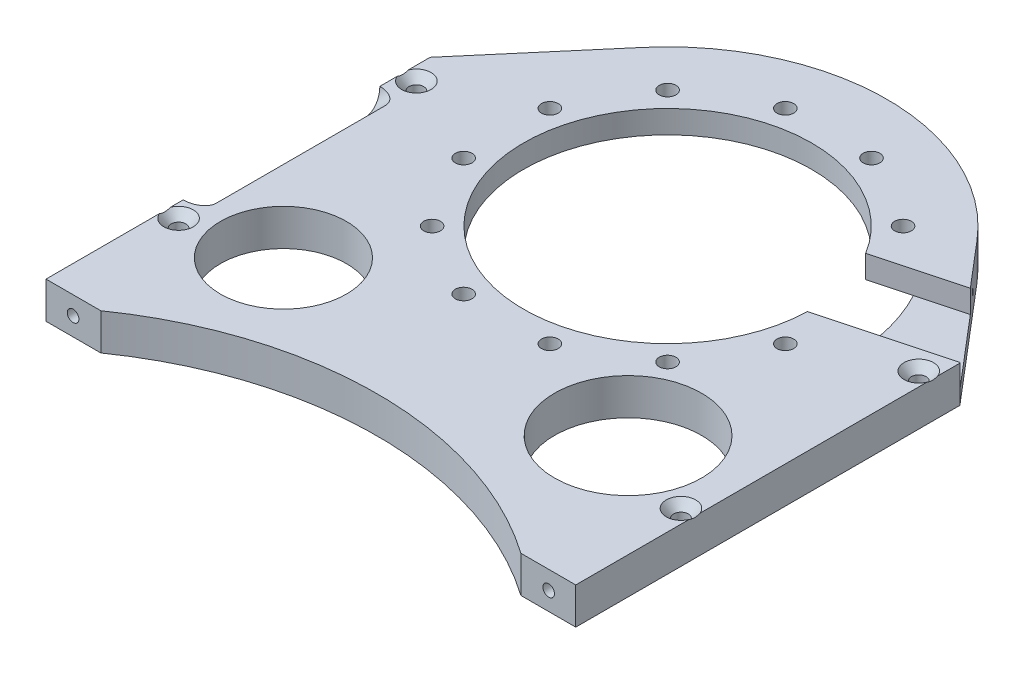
ISO-10303-21;
HEADER;
FILE_DESCRIPTION(('STEP AP214'),'2;1');
FILE_NAME('part.step','',(''),(''),'','','');
FILE_SCHEMA(('AUTOMOTIVE_DESIGN { 1 0 10303 214 1 1 1 1 }'));
ENDSEC;
DATA;
#1=APPLICATION_CONTEXT('core data for automotive mechanical design processes');
#2=APPLICATION_PROTOCOL_DEFINITION('international standard','automotive_design',2000,#1);
#3=PRODUCT_CONTEXT('',#1,'mechanical');
#4=PRODUCT('Part','Part','',(#3));
#5=PRODUCT_RELATED_PRODUCT_CATEGORY('part','',(#4));
#6=PRODUCT_DEFINITION_FORMATION('','',#4);
#7=PRODUCT_DEFINITION_CONTEXT('part definition',#1,'design');
#8=PRODUCT_DEFINITION('design','',#6,#7);
#9=PRODUCT_DEFINITION_SHAPE('','',#8);
#10=(LENGTH_UNIT() NAMED_UNIT(*) SI_UNIT(.MILLI.,.METRE.));
#11=(NAMED_UNIT(*) PLANE_ANGLE_UNIT() SI_UNIT($,.RADIAN.));
#12=(NAMED_UNIT(*) SI_UNIT($,.STERADIAN.) SOLID_ANGLE_UNIT());
#13=UNCERTAINTY_MEASURE_WITH_UNIT(LENGTH_MEASURE(1.E-05),#10,'distance_accuracy_value','');
#14=(GEOMETRIC_REPRESENTATION_CONTEXT(3) GLOBAL_UNCERTAINTY_ASSIGNED_CONTEXT((#13)) GLOBAL_UNIT_ASSIGNED_CONTEXT((#10,
#11,#12)) REPRESENTATION_CONTEXT('',''));
#15=CARTESIAN_POINT('',(0.,0.,0.));
#16=DIRECTION('',(0.,0.,1.));
#17=DIRECTION('',(1.,0.,0.));
#18=AXIS2_PLACEMENT_3D('',#15,#16,#17);
#19=CARTESIAN_POINT('',(-91.948,34.1376,-25.3999999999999));
#20=DIRECTION('',(-1.,0.,0.));
#21=DIRECTION('',(0.,0.,1.));
#22=AXIS2_PLACEMENT_3D('',#19,#20,#21);
#23=PLANE('',#22);
#24=CARTESIAN_POINT('',(-91.948,46.8376,-77.7875));
#25=DIRECTION('',(-1.,0.,0.));
#26=DIRECTION('',(0.,1.,0.));
#27=AXIS2_PLACEMENT_3D('',#24,#25,#26);
#28=ELLIPSE('',#27,6.73519209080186,4.7625);
#29=CARTESIAN_POINT('',(-91.948,40.1024079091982,-77.7875));
#30=VERTEX_POINT('',#29);
#31=CARTESIAN_POINT('',(-91.9480000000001,46.8376,-73.025));
#32=VERTEX_POINT('',#31);
#33=EDGE_CURVE('E275',#30,#32,#28,.T.);
#34=ORIENTED_EDGE('',*,*,#33,.F.);
#35=DIRECTION('',(0.,0.,1.));
#36=VECTOR('',#35,1.);
#37=CARTESIAN_POINT('',(-91.948,40.1024079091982,-25.3999999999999));
#38=LINE('',#37,#36);
#39=CARTESIAN_POINT('',(-91.948,40.1024079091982,-136.525));
#40=VERTEX_POINT('',#39);
#41=EDGE_CURVE('E267',#40,#30,#38,.T.);
#42=ORIENTED_EDGE('',*,*,#41,.F.);
#43=CARTESIAN_POINT('',(-91.948,46.8376,-136.525));
#44=DIRECTION('',(-1.,0.,0.));
#45=DIRECTION('',(0.,1.,0.));
#46=AXIS2_PLACEMENT_3D('',#43,#44,#45);
#47=ELLIPSE('',#46,6.73519209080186,4.7625);
#48=CARTESIAN_POINT('',(-91.9480000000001,46.8376,-141.2875));
#49=VERTEX_POINT('',#48);
#50=EDGE_CURVE('E272',#49,#40,#47,.T.);
#51=ORIENTED_EDGE('',*,*,#50,.F.);
#52=DIRECTION('',(0.,0.,1.));
#53=VECTOR('',#52,1.);
#54=CARTESIAN_POINT('',(-91.948,46.8376,-25.3999999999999));
#55=LINE('',#54,#53);
#56=CARTESIAN_POINT('',(-91.948,46.8376,-147.349505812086));
#57=VERTEX_POINT('',#56);
#58=EDGE_CURVE('E505',#57,#49,#55,.T.);
#59=ORIENTED_EDGE('',*,*,#58,.F.);
#60=CARTESIAN_POINT('',(-91.948,52.9108646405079,-158.461342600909));
#61=CARTESIAN_POINT('',(-91.948,52.7190047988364,-158.273780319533));
#62=CARTESIAN_POINT('',(-91.948,52.5277207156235,-158.085624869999));
#63=CARTESIAN_POINT('',(-91.948,52.1465706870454,-157.707861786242));
#64=CARTESIAN_POINT('',(-91.948,51.9567048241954,-157.518254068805));
#65=CARTESIAN_POINT('',(-91.948,51.5782587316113,-157.136917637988));
#66=CARTESIAN_POINT('',(-91.948,51.3896823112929,-156.945185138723));
#67=CARTESIAN_POINT('',(-91.948,51.0146318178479,-156.559680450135));
#68=CARTESIAN_POINT('',(-91.948,50.8281576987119,-156.36590830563));
#69=CARTESIAN_POINT('',(-91.948,50.4479860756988,-155.96555114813));
#70=CARTESIAN_POINT('',(-91.948,50.2544299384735,-155.758831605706));
#71=CARTESIAN_POINT('',(-91.948,49.870996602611,-155.342010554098));
#72=CARTESIAN_POINT('',(-91.948,49.6811192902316,-155.131909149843));
#73=CARTESIAN_POINT('',(-91.948,49.3063312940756,-154.707663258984));
#74=CARTESIAN_POINT('',(-91.948,49.1214160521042,-154.49352281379));
#75=CARTESIAN_POINT('',(-91.948,48.7579898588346,-154.059894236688));
#76=CARTESIAN_POINT('',(-91.948,48.5794779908,-153.840406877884));
#77=CARTESIAN_POINT('',(-91.948,48.2425501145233,-153.409028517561));
#78=CARTESIAN_POINT('',(-91.948,48.0835821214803,-153.19757131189));
#79=CARTESIAN_POINT('',(-91.948,47.7761542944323,-152.7668217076));
#80=CARTESIAN_POINT('',(-91.948,47.6277023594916,-152.547523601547));
#81=CARTESIAN_POINT('',(-91.948,47.3477669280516,-152.102147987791));
#82=CARTESIAN_POINT('',(-91.948,47.2160909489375,-151.876192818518));
#83=CARTESIAN_POINT('',(-91.948,46.9743270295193,-151.4131299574));
#84=CARTESIAN_POINT('',(-91.948,46.8641996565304,-151.176043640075));
#85=CARTESIAN_POINT('',(-91.948,46.7330815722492,-150.839170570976));
#86=CARTESIAN_POINT('',(-91.948,46.6988866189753,-150.74448947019));
#87=CARTESIAN_POINT('',(-91.948,46.6356805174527,-150.553158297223));
#88=CARTESIAN_POINT('',(-91.948,46.6066814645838,-150.456504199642));
#89=CARTESIAN_POINT('',(-91.948,46.5483030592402,-150.237967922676));
#90=CARTESIAN_POINT('',(-91.948,46.5205344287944,-150.115648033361));
#91=CARTESIAN_POINT('',(-91.948,46.4752963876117,-149.869072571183));
#92=CARTESIAN_POINT('',(-91.948,46.4578289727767,-149.744816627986));
#93=CARTESIAN_POINT('',(-91.948,46.4340503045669,-149.495394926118));
#94=CARTESIAN_POINT('',(-91.948,46.4277240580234,-149.370230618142));
#95=CARTESIAN_POINT('',(-91.948,46.4265092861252,-149.119854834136));
#96=CARTESIAN_POINT('',(-91.948,46.4316198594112,-148.994643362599));
#97=CARTESIAN_POINT('',(-91.948,46.4527005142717,-148.748803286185));
#98=CARTESIAN_POINT('',(-91.948,46.4683522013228,-148.628146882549));
#99=CARTESIAN_POINT('',(-91.948,46.5094777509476,-148.388514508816));
#100=CARTESIAN_POINT('',(-91.948,46.5349536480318,-148.269538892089));
#101=CARTESIAN_POINT('',(-91.948,46.5947637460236,-148.033644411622));
#102=CARTESIAN_POINT('',(-91.948,46.6291129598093,-147.916729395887));
#103=CARTESIAN_POINT('',(-91.948,46.7055067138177,-147.685463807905));
#104=CARTESIAN_POINT('',(-91.948,46.7475514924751,-147.571113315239));
#105=CARTESIAN_POINT('',(-91.948,46.8478825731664,-147.320957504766));
#106=CARTESIAN_POINT('',(-91.948,46.9077203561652,-147.185777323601));
#107=CARTESIAN_POINT('',(-91.948,47.0352880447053,-146.919169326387));
#108=CARTESIAN_POINT('',(-91.948,47.1030211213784,-146.787743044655));
#109=CARTESIAN_POINT('',(-91.948,47.2449701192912,-146.528206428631));
#110=CARTESIAN_POINT('',(-91.948,47.3191956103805,-146.400101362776));
#111=CARTESIAN_POINT('',(-91.948,47.4728410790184,-146.147040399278));
#112=CARTESIAN_POINT('',(-91.948,47.5522617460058,-146.022084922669));
#113=CARTESIAN_POINT('',(-91.948,47.716554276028,-145.773122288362));
#114=CARTESIAN_POINT('',(-91.948,47.8014900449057,-145.649157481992));
#115=CARTESIAN_POINT('',(-91.948,47.9749317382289,-145.403755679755));
#116=CARTESIAN_POINT('',(-91.948,48.0634377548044,-145.282318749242));
#117=CARTESIAN_POINT('',(-91.948,48.2433105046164,-145.041775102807));
#118=CARTESIAN_POINT('',(-91.948,48.3346743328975,-144.922666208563));
#119=CARTESIAN_POINT('',(-91.948,48.5198541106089,-144.686382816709));
#120=CARTESIAN_POINT('',(-91.948,48.613669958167,-144.569208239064));
#121=CARTESIAN_POINT('',(-91.948,48.8182914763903,-144.318241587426));
#122=CARTESIAN_POINT('',(-91.948,48.9294477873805,-144.184735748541));
#123=CARTESIAN_POINT('',(-91.948,49.1540551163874,-143.919666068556));
#124=CARTESIAN_POINT('',(-91.948,49.2675062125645,-143.788102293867));
#125=CARTESIAN_POINT('',(-91.948,49.6107523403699,-143.395879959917));
#126=CARTESIAN_POINT('',(-91.948,49.8434104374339,-143.13772648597));
#127=CARTESIAN_POINT('',(-91.948,50.3143168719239,-142.626335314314));
#128=CARTESIAN_POINT('',(-91.948,50.5525682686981,-142.373100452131));
#129=CARTESIAN_POINT('',(-91.948,51.033160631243,-141.870533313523));
#130=CARTESIAN_POINT('',(-91.948,51.2755017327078,-141.62120116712));
#131=CARTESIAN_POINT('',(-91.948,51.7639487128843,-141.124954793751));
#132=CARTESIAN_POINT('',(-91.948,52.0100628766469,-140.878048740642));
#133=CARTESIAN_POINT('',(-91.948,52.5047453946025,-140.386703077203));
#134=CARTESIAN_POINT('',(-91.948,52.7533137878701,-140.142263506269));
#135=CARTESIAN_POINT('',(-91.948,53.2523140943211,-139.655472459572));
#136=CARTESIAN_POINT('',(-91.948,53.5027453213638,-139.413120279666));
#137=CARTESIAN_POINT('',(-91.948,54.0051894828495,-138.930061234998));
#138=CARTESIAN_POINT('',(-91.948,54.2572024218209,-138.689354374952));
#139=CARTESIAN_POINT('',(-91.948,54.9528633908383,-138.028475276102));
#140=CARTESIAN_POINT('',(-91.948,55.3978517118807,-137.609714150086));
#141=CARTESIAN_POINT('',(-91.948,56.2907595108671,-136.775244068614));
#142=CARTESIAN_POINT('',(-91.948,56.7386792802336,-136.359535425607));
#143=CARTESIAN_POINT('',(-91.948,57.6344635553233,-135.53252731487));
#144=CARTESIAN_POINT('',(-91.948,58.0823173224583,-135.121216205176));
#145=CARTESIAN_POINT('',(-91.948,58.979658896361,-134.300489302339));
#146=CARTESIAN_POINT('',(-91.948,59.4291464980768,-133.891073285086));
#147=CARTESIAN_POINT('',(-91.948,59.8792476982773,-133.48233737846));
#148=B_SPLINE_CURVE_WITH_KNOTS('',3,(#60,#61,#62,#63,#64,#65,#66,#67,#68,#69,#70,#71,#72,#73,
#74,#75,#76,#77,#78,#79,#80,#81,#82,#83,#84,#85,#86,#87,#88,#89,#90,#91,#92,#93,#94,#95,#96,#97,
#98,#99,#100,#101,#102,#103,#104,#105,#106,#107,#108,#109,#110,#111,#112,#113,#114,#115,#116,
#117,#118,#119,#120,#121,#122,#123,#124,#125,#126,#127,#128,#129,#130,#131,#132,#133,#134,#135,
#136,#137,#138,#139,#140,#141,#142,#143,#144,#145,#146,#147),.UNSPECIFIED.,.F.,.F.,(4,2,2,2,2,2,
2,2,2,2,2,2,2,2,2,2,2,2,2,2,2,2,2,2,2,2,2,2,2,2,2,2,2,2,2,2,2,2,2,2,2,2,2,4),(0.,
0.804930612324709,1.60990769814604,2.41667922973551,3.22343307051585,4.07297059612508,
4.92248181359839,5.77118391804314,6.61976402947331,7.41317731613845,8.20718038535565,
8.9910437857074,9.7734590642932,10.0753341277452,10.3779030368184,10.7537922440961,
11.1297542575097,11.5052099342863,11.8806360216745,12.2452026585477,12.6098448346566,
12.9751080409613,13.3403825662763,13.7835548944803,14.2269058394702,14.6709216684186,
15.1149965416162,15.5657336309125,16.0164823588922,16.4667869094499,16.9170727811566,
17.438208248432,17.9593614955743,19.0018083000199,20.0448392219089,21.0879048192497,
22.1337388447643,23.1795895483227,24.2250724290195,25.2705583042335,27.1036694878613,
28.9369657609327,30.7611717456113,32.585156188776),.UNSPECIFIED.);
#149=CARTESIAN_POINT('',(-91.948,46.8376,-151.100494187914));
#150=VERTEX_POINT('',#149);
#151=EDGE_CURVE('E632',#150,#57,#148,.T.);
#152=ORIENTED_EDGE('',*,*,#151,.F.);
#153=CARTESIAN_POINT('',(-91.948,46.8376,-158.75));
#154=VERTEX_POINT('',#153);
#155=EDGE_CURVE('E500',#154,#150,#55,.T.);
#156=ORIENTED_EDGE('',*,*,#155,.F.);
#157=DIRECTION('',(0.,1.,0.));
#158=VECTOR('',#157,1.);
#159=CARTESIAN_POINT('',(-91.948,34.1376,-158.75));
#160=LINE('',#159,#158);
#161=CARTESIAN_POINT('',(-91.948,34.1376,-158.75));
#162=VERTEX_POINT('',#161);
#163=EDGE_CURVE('E532',#162,#154,#160,.T.);
#164=ORIENTED_EDGE('',*,*,#163,.F.);
#165=DIRECTION('',(0.,0.,1.));
#166=VECTOR('',#165,1.);
#167=CARTESIAN_POINT('',(-91.948,34.1376,-25.3999999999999));
#168=LINE('',#167,#166);
#169=CARTESIAN_POINT('',(-91.948,34.1376,-25.3999999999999));
#170=VERTEX_POINT('',#169);
#171=EDGE_CURVE('E469',#162,#170,#168,.T.);
#172=ORIENTED_EDGE('',*,*,#171,.T.);
#173=DIRECTION('',(0.,1.,0.));
#174=VECTOR('',#173,1.);
#175=CARTESIAN_POINT('',(-91.948,34.1376,-25.3999999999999));
#176=LINE('',#175,#174);
#177=CARTESIAN_POINT('',(-91.948,46.8376,-25.3999999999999));
#178=VERTEX_POINT('',#177);
#179=EDGE_CURVE('E499',#170,#178,#176,.T.);
#180=ORIENTED_EDGE('',*,*,#179,.T.);
#181=CARTESIAN_POINT('',(-91.948,46.8376,-64.7995058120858));
#182=VERTEX_POINT('',#181);
#183=EDGE_CURVE('E468',#182,#178,#55,.T.);
#184=ORIENTED_EDGE('',*,*,#183,.F.);
#185=CARTESIAN_POINT('',(-91.948,52.9108646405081,-75.9113426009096));
#186=CARTESIAN_POINT('',(-91.948,52.7190047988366,-75.7237803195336));
#187=CARTESIAN_POINT('',(-91.948,52.5277207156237,-75.5356248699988));
#188=CARTESIAN_POINT('',(-91.948,52.1465706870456,-75.1578617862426));
#189=CARTESIAN_POINT('',(-91.948,51.9567048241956,-74.9682540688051));
#190=CARTESIAN_POINT('',(-91.948,51.5782587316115,-74.5869176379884));
#191=CARTESIAN_POINT('',(-91.948,51.3896823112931,-74.3951851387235));
#192=CARTESIAN_POINT('',(-91.948,51.0146318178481,-74.0096804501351));
#193=CARTESIAN_POINT('',(-91.948,50.8281576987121,-73.81590830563));
#194=CARTESIAN_POINT('',(-91.948,50.447986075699,-73.4155511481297));
#195=CARTESIAN_POINT('',(-91.948,50.2544299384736,-73.2088316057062));
#196=CARTESIAN_POINT('',(-91.948,49.8709966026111,-72.792010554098));
#197=CARTESIAN_POINT('',(-91.948,49.6811192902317,-72.5819091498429));
#198=CARTESIAN_POINT('',(-91.948,49.3063312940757,-72.1576632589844));
#199=CARTESIAN_POINT('',(-91.948,49.1214160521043,-71.9435228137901));
#200=CARTESIAN_POINT('',(-91.948,48.7579898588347,-71.5098942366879));
#201=CARTESIAN_POINT('',(-91.948,48.5794779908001,-71.2904068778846));
#202=CARTESIAN_POINT('',(-91.948,48.2425501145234,-70.859028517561));
#203=CARTESIAN_POINT('',(-91.948,48.0835821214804,-70.6475713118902));
#204=CARTESIAN_POINT('',(-91.948,47.7761542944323,-70.2168217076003));
#205=CARTESIAN_POINT('',(-91.948,47.6277023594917,-69.9975236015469));
#206=CARTESIAN_POINT('',(-91.948,47.3477669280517,-69.5521479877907));
#207=CARTESIAN_POINT('',(-91.948,47.2160909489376,-69.3261928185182));
#208=CARTESIAN_POINT('',(-91.948,46.9743270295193,-68.8631299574));
#209=CARTESIAN_POINT('',(-91.948,46.8641996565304,-68.6260436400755));
#210=CARTESIAN_POINT('',(-91.948,46.7330815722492,-68.2891705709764));
#211=CARTESIAN_POINT('',(-91.948,46.6988866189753,-68.1944894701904));
#212=CARTESIAN_POINT('',(-91.948,46.6356805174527,-68.0031582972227));
#213=CARTESIAN_POINT('',(-91.948,46.6066814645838,-67.9065041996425));
#214=CARTESIAN_POINT('',(-91.948,46.5483030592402,-67.6879679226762));
#215=CARTESIAN_POINT('',(-91.948,46.5205344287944,-67.5656480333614));
#216=CARTESIAN_POINT('',(-91.948,46.4752963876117,-67.3190725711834));
#217=CARTESIAN_POINT('',(-91.948,46.4578289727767,-67.1948166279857));
#218=CARTESIAN_POINT('',(-91.948,46.4340503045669,-66.9453949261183));
#219=CARTESIAN_POINT('',(-91.948,46.4277240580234,-66.8202306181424));
#220=CARTESIAN_POINT('',(-91.948,46.4265092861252,-66.5698548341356));
#221=CARTESIAN_POINT('',(-91.948,46.4316198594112,-66.4446433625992));
#222=CARTESIAN_POINT('',(-91.948,46.4527005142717,-66.1988032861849));
#223=CARTESIAN_POINT('',(-91.948,46.4683522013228,-66.0781468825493));
#224=CARTESIAN_POINT('',(-91.948,46.5094777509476,-65.8385145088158));
#225=CARTESIAN_POINT('',(-91.948,46.5349536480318,-65.7195388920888));
#226=CARTESIAN_POINT('',(-91.948,46.5947637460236,-65.4836444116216));
#227=CARTESIAN_POINT('',(-91.948,46.6291129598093,-65.366729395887));
#228=CARTESIAN_POINT('',(-91.948,46.7055067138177,-65.1354638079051));
#229=CARTESIAN_POINT('',(-91.948,46.7475514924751,-65.0211133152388));
#230=CARTESIAN_POINT('',(-91.948,46.8478825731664,-64.770957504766));
#231=CARTESIAN_POINT('',(-91.948,46.9077203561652,-64.635777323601));
#232=CARTESIAN_POINT('',(-91.948,47.0352880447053,-64.3691693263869));
#233=CARTESIAN_POINT('',(-91.948,47.1030211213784,-64.237743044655));
#234=CARTESIAN_POINT('',(-91.948,47.2449701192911,-63.9782064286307));
#235=CARTESIAN_POINT('',(-91.948,47.3191956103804,-63.8501013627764));
#236=CARTESIAN_POINT('',(-91.948,47.4728410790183,-63.5970403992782));
#237=CARTESIAN_POINT('',(-91.948,47.5522617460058,-63.4720849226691));
#238=CARTESIAN_POINT('',(-91.948,47.716554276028,-63.2231222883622));
#239=CARTESIAN_POINT('',(-91.948,47.8014900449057,-63.0991574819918));
#240=CARTESIAN_POINT('',(-91.948,47.9749317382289,-62.8537556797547));
#241=CARTESIAN_POINT('',(-91.948,48.0634377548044,-62.7323187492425));
#242=CARTESIAN_POINT('',(-91.948,48.2433105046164,-62.4917751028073));
#243=CARTESIAN_POINT('',(-91.948,48.3346743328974,-62.3726662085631));
#244=CARTESIAN_POINT('',(-91.948,48.5198541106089,-62.1363828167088));
#245=CARTESIAN_POINT('',(-91.948,48.6136699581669,-62.0192082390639));
#246=CARTESIAN_POINT('',(-91.948,48.8182914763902,-61.7682415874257));
#247=CARTESIAN_POINT('',(-91.948,48.9294477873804,-61.634735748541));
#248=CARTESIAN_POINT('',(-91.948,49.1540551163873,-61.3696660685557));
#249=CARTESIAN_POINT('',(-91.948,49.2675062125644,-61.2381022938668));
#250=CARTESIAN_POINT('',(-91.948,49.6107523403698,-60.8458799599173));
#251=CARTESIAN_POINT('',(-91.948,49.8434104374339,-60.5877264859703));
#252=CARTESIAN_POINT('',(-91.948,50.3143168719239,-60.0763353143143));
#253=CARTESIAN_POINT('',(-91.948,50.552568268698,-59.8231004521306));
#254=CARTESIAN_POINT('',(-91.948,51.033160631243,-59.3205333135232));
#255=CARTESIAN_POINT('',(-91.948,51.2755017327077,-59.0712011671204));
#256=CARTESIAN_POINT('',(-91.948,51.7639487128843,-58.5749547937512));
#257=CARTESIAN_POINT('',(-91.948,52.0100628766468,-58.3280487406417));
#258=CARTESIAN_POINT('',(-91.948,52.5047453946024,-57.8367030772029));
#259=CARTESIAN_POINT('',(-91.948,52.7533137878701,-57.5922635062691));
#260=CARTESIAN_POINT('',(-91.948,53.252314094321,-57.1054724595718));
#261=CARTESIAN_POINT('',(-91.948,53.5027453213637,-56.8631202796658));
#262=CARTESIAN_POINT('',(-91.948,54.0051894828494,-56.3800612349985));
#263=CARTESIAN_POINT('',(-91.948,54.2572024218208,-56.1393543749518));
#264=CARTESIAN_POINT('',(-91.948,54.9528633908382,-55.4784752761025));
#265=CARTESIAN_POINT('',(-91.948,55.3978517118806,-55.059714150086));
#266=CARTESIAN_POINT('',(-91.948,56.290759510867,-54.2252440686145));
#267=CARTESIAN_POINT('',(-91.948,56.7386792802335,-53.8095354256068));
#268=CARTESIAN_POINT('',(-91.948,57.6344635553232,-52.9825273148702));
#269=CARTESIAN_POINT('',(-91.948,58.0823173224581,-52.5712162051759));
#270=CARTESIAN_POINT('',(-91.948,58.9796588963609,-51.7504893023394));
#271=CARTESIAN_POINT('',(-91.948,59.4291464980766,-51.3410732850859));
#272=CARTESIAN_POINT('',(-91.948,59.8792476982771,-50.9323373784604));
#273=B_SPLINE_CURVE_WITH_KNOTS('',3,(#185,#186,#187,#188,#189,#190,#191,#192,#193,#194,#195,
#196,#197,#198,#199,#200,#201,#202,#203,#204,#205,#206,#207,#208,#209,#210,#211,#212,#213,#214,
#215,#216,#217,#218,#219,#220,#221,#222,#223,#224,#225,#226,#227,#228,#229,#230,#231,#232,#233,
#234,#235,#236,#237,#238,#239,#240,#241,#242,#243,#244,#245,#246,#247,#248,#249,#250,#251,#252,
#253,#254,#255,#256,#257,#258,#259,#260,#261,#262,#263,#264,#265,#266,#267,#268,#269,#270,#271,
#272),.UNSPECIFIED.,.F.,.F.,(4,2,2,2,2,2,2,2,2,2,2,2,2,2,2,2,2,2,2,2,2,2,2,2,2,2,2,2,2,2,2,2,2,
2,2,2,2,2,2,2,2,2,2,4),(0.,0.804930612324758,1.60990769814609,2.4166792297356,3.22343307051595,
4.07297059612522,4.92248181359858,5.77118391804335,6.61976402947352,7.41317731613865,
8.20718038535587,8.99104378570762,9.77345906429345,10.0753341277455,10.3779030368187,
10.7537922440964,11.12975425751,11.5052099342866,11.8806360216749,12.245202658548,
12.609844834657,12.9751080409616,13.3403825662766,13.7835548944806,14.2269058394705,
14.6709216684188,15.1149965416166,15.5657336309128,16.0164823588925,16.4667869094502,
16.9170727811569,17.4382082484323,17.9593614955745,19.0018083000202,20.0448392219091,
21.0879048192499,22.1337388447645,23.1795895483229,24.2250724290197,25.2705583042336,
27.1036694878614,28.9369657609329,30.7611717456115,32.5851561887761),.UNSPECIFIED.);
#274=CARTESIAN_POINT('',(-91.948,46.8376,-68.5504941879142));
#275=VERTEX_POINT('',#274);
#276=EDGE_CURVE('E628',#275,#182,#273,.T.);
#277=ORIENTED_EDGE('',*,*,#276,.F.);
#278=EDGE_CURVE('E73',#32,#275,#55,.T.);
#279=ORIENTED_EDGE('',*,*,#278,.F.);
#280=EDGE_LOOP('',(#34,#42,#51,#59,#152,#156,#164,#172,#180,#184,#277,#279));
#281=FACE_BOUND('',#280,.T.);
#282=ADVANCED_FACE('F46',(#281),#23,.T.);
#283=CARTESIAN_POINT('',(-91.948,34.1376,-158.75));
#284=DIRECTION('',(-0.761596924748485,0.,-0.648051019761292));
#285=DIRECTION('',(-0.648051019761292,0.,0.761596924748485));
#286=AXIS2_PLACEMENT_3D('',#283,#284,#285);
#287=PLANE('',#286);
#288=CARTESIAN_POINT('',(-83.7177520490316,40.4876,-168.422280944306));
#289=DIRECTION('',(-0.761596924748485,0.,-0.648051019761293));
#290=DIRECTION('',(-0.648051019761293,0.,0.761596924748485));
#291=AXIS2_PLACEMENT_3D('',#288,#289,#290);
#292=CIRCLE('',#291,1.1303);
#293=CARTESIAN_POINT('',(-84.4502441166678,40.4876,-167.561447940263));
#294=VERTEX_POINT('',#293);
#295=EDGE_CURVE('E240',#294,#294,#292,.T.);
#296=ORIENTED_EDGE('',*,*,#295,.F.);
#297=EDGE_LOOP('',(#296));
#298=FACE_BOUND('',#297,.T.);
#299=CARTESIAN_POINT('',(-66.2625360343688,40.4876,-188.935849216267));
#300=DIRECTION('',(-0.761596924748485,0.,-0.648051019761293));
#301=DIRECTION('',(-0.648051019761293,0.,0.761596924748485));
#302=AXIS2_PLACEMENT_3D('',#299,#300,#301);
#303=CIRCLE('',#302,1.1303);
#304=CARTESIAN_POINT('',(-66.995028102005,40.4876,-188.075016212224));
#305=VERTEX_POINT('',#304);
#306=EDGE_CURVE('E255',#305,#305,#303,.T.);
#307=ORIENTED_EDGE('',*,*,#306,.F.);
#308=EDGE_LOOP('',(#307));
#309=FACE_BOUND('',#308,.T.);
#310=DIRECTION('',(-0.648051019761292,0.,0.761596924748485));
#311=VECTOR('',#310,1.);
#312=CARTESIAN_POINT('',(-91.948,46.8376,-158.75));
#313=LINE('',#312,#311);
#314=CARTESIAN_POINT('',(-58.0336856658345,46.8376,-198.60648770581));
#315=VERTEX_POINT('',#314);
#316=EDGE_CURVE('E474',#315,#154,#313,.T.);
#317=ORIENTED_EDGE('',*,*,#316,.F.);
#318=DIRECTION('',(0.,1.,0.));
#319=VECTOR('',#318,1.);
#320=CARTESIAN_POINT('',(-58.0336856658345,34.1376,-198.60648770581));
#321=LINE('',#320,#319);
#322=CARTESIAN_POINT('',(-58.0336856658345,34.1376,-198.60648770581));
#323=VERTEX_POINT('',#322);
#324=EDGE_CURVE('E536',#323,#315,#321,.T.);
#325=ORIENTED_EDGE('',*,*,#324,.F.);
#326=DIRECTION('',(-0.648051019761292,0.,0.761596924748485));
#327=VECTOR('',#326,1.);
#328=CARTESIAN_POINT('',(-91.948,34.1376,-158.75));
#329=LINE('',#328,#327);
#330=EDGE_CURVE('E495',#323,#162,#329,.T.);
#331=ORIENTED_EDGE('',*,*,#330,.T.);
#332=ORIENTED_EDGE('',*,*,#163,.T.);
#333=EDGE_LOOP('',(#317,#325,#331,#332));
#334=FACE_BOUND('',#333,.T.);
#335=ADVANCED_FACE('F607',(#298,#309,#334),#287,.T.);
#336=CARTESIAN_POINT('',(0.,34.1376,-149.225));
#337=DIRECTION('',(0.,1.,0.));
#338=DIRECTION('',(0.,0.,1.));
#339=AXIS2_PLACEMENT_3D('',#336,#337,#338);
#340=CYLINDRICAL_SURFACE('',#339,76.2);
#341=CARTESIAN_POINT('',(0.,46.8376,-149.225));
#342=DIRECTION('',(0.,1.,0.));
#343=DIRECTION('',(0.,0.,1.));
#344=AXIS2_PLACEMENT_3D('',#341,#342,#343);
#345=CIRCLE('',#344,76.2);
#346=CARTESIAN_POINT('',(58.0336856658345,46.8376,-198.60648770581));
#347=VERTEX_POINT('',#346);
#348=EDGE_CURVE('E525',#347,#315,#345,.T.);
#349=ORIENTED_EDGE('',*,*,#348,.F.);
#350=DIRECTION('',(0.,1.,0.));
#351=VECTOR('',#350,1.);
#352=CARTESIAN_POINT('',(58.0336856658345,34.1376,-198.60648770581));
#353=LINE('',#352,#351);
#354=CARTESIAN_POINT('',(58.0336856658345,34.1376,-198.60648770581));
#355=VERTEX_POINT('',#354);
#356=EDGE_CURVE('E539',#355,#347,#353,.T.);
#357=ORIENTED_EDGE('',*,*,#356,.F.);
#358=CARTESIAN_POINT('',(0.,34.1376,-149.225));
#359=DIRECTION('',(0.,1.,0.));
#360=DIRECTION('',(0.,0.,1.));
#361=AXIS2_PLACEMENT_3D('',#358,#359,#360);
#362=CIRCLE('',#361,76.2);
#363=EDGE_CURVE('E491',#355,#323,#362,.T.);
#364=ORIENTED_EDGE('',*,*,#363,.T.);
#365=ORIENTED_EDGE('',*,*,#324,.T.);
#366=EDGE_LOOP('',(#349,#357,#364,#365));
#367=FACE_BOUND('',#366,.T.);
#368=ADVANCED_FACE('F612',(#367),#340,.T.);
#369=CARTESIAN_POINT('',(91.948,34.1376,-158.75));
#370=DIRECTION('',(0.761596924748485,0.,-0.648051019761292));
#371=DIRECTION('',(-0.648051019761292,0.,-0.761596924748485));
#372=AXIS2_PLACEMENT_3D('',#369,#370,#371);
#373=PLANE('',#372);
#374=CARTESIAN_POINT('',(66.2696263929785,40.4876,-188.927516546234));
#375=DIRECTION('',(0.761596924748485,0.,-0.648051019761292));
#376=DIRECTION('',(-0.648051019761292,0.,-0.761596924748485));
#377=AXIS2_PLACEMENT_3D('',#374,#375,#376);
#378=CIRCLE('',#377,1.13029999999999);
#379=CARTESIAN_POINT('',(65.5371343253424,40.4876,-189.788349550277));
#380=VERTEX_POINT('',#379);
#381=EDGE_CURVE('E241',#380,#380,#378,.T.);
#382=ORIENTED_EDGE('',*,*,#381,.F.);
#383=EDGE_LOOP('',(#382));
#384=FACE_BOUND('',#383,.T.);
#385=DIRECTION('',(0.,1.,0.));
#386=VECTOR('',#385,1.);
#387=CARTESIAN_POINT('',(71.226881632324,34.1376,-183.101693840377));
#388=LINE('',#387,#386);
#389=CARTESIAN_POINT('',(71.226881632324,38.9001,-183.101693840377));
#390=VERTEX_POINT('',#389);
#391=CARTESIAN_POINT('',(71.226881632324,46.8376,-183.101693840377));
#392=VERTEX_POINT('',#391);
#393=EDGE_CURVE('E452',#390,#392,#388,.T.);
#394=ORIENTED_EDGE('',*,*,#393,.F.);
#395=DIRECTION('',(0.648051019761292,0.,0.761596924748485));
#396=VECTOR('',#395,1.);
#397=CARTESIAN_POINT('',(91.948,38.9001,-158.75));
#398=LINE('',#397,#396);
#399=CARTESIAN_POINT('',(91.7256519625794,38.9001,-159.011305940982));
#400=VERTEX_POINT('',#399);
#401=EDGE_CURVE('E437',#390,#400,#398,.T.);
#402=ORIENTED_EDGE('',*,*,#401,.T.);
#403=DIRECTION('',(0.,-1.,0.));
#404=VECTOR('',#403,1.);
#405=CARTESIAN_POINT('',(91.7256519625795,34.1376,-159.011305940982));
#406=LINE('',#405,#404);
#407=CARTESIAN_POINT('',(91.7256519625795,46.8376,-159.011305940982));
#408=VERTEX_POINT('',#407);
#409=EDGE_CURVE('E445',#408,#400,#406,.T.);
#410=ORIENTED_EDGE('',*,*,#409,.F.);
#411=DIRECTION('',(-0.648051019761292,0.,-0.761596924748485));
#412=VECTOR('',#411,1.);
#413=CARTESIAN_POINT('',(91.948,46.8376,-158.75));
#414=LINE('',#413,#412);
#415=CARTESIAN_POINT('',(91.948,46.8376,-158.75));
#416=VERTEX_POINT('',#415);
#417=EDGE_CURVE('E521',#416,#408,#414,.T.);
#418=ORIENTED_EDGE('',*,*,#417,.F.);
#419=DIRECTION('',(0.,1.,0.));
#420=VECTOR('',#419,1.);
#421=CARTESIAN_POINT('',(91.948,34.1376,-158.75));
#422=LINE('',#421,#420);
#423=CARTESIAN_POINT('',(91.948,34.1376,-158.75));
#424=VERTEX_POINT('',#423);
#425=EDGE_CURVE('E543',#424,#416,#422,.T.);
#426=ORIENTED_EDGE('',*,*,#425,.F.);
#427=DIRECTION('',(-0.648051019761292,0.,-0.761596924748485));
#428=VECTOR('',#427,1.);
#429=CARTESIAN_POINT('',(91.948,34.1376,-158.75));
#430=LINE('',#429,#428);
#431=EDGE_CURVE('E487',#424,#355,#430,.T.);
#432=ORIENTED_EDGE('',*,*,#431,.T.);
#433=ORIENTED_EDGE('',*,*,#356,.T.);
#434=EDGE_CURVE('E519',#392,#347,#414,.T.);
#435=ORIENTED_EDGE('',*,*,#434,.F.);
#436=EDGE_LOOP('',(#394,#402,#410,#418,#426,#432,#433,#435));
#437=FACE_BOUND('',#436,.T.);
#438=ADVANCED_FACE('F584',(#384,#437),#373,.T.);
#439=CARTESIAN_POINT('',(91.948,34.1376,-25.4));
#440=DIRECTION('',(1.,0.,0.));
#441=DIRECTION('',(0.,0.,-1.));
#442=AXIS2_PLACEMENT_3D('',#439,#440,#441);
#443=PLANE('',#442);
#444=CARTESIAN_POINT('',(91.948,52.910864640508,-75.9113426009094));
#445=CARTESIAN_POINT('',(91.948,52.7190047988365,-75.7237803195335));
#446=CARTESIAN_POINT('',(91.948,52.5277207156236,-75.5356248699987));
#447=CARTESIAN_POINT('',(91.948,52.1465706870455,-75.1578617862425));
#448=CARTESIAN_POINT('',(91.948,51.9567048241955,-74.968254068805));
#449=CARTESIAN_POINT('',(91.948,51.5782587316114,-74.5869176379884));
#450=CARTESIAN_POINT('',(91.948,51.389682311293,-74.3951851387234));
#451=CARTESIAN_POINT('',(91.948,51.014631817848,-74.0096804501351));
#452=CARTESIAN_POINT('',(91.948,50.828157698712,-73.8159083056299));
#453=CARTESIAN_POINT('',(91.948,50.4479860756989,-73.4155511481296));
#454=CARTESIAN_POINT('',(91.948,50.2544299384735,-73.2088316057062));
#455=CARTESIAN_POINT('',(91.948,49.870996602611,-72.792010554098));
#456=CARTESIAN_POINT('',(91.948,49.6811192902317,-72.5819091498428));
#457=CARTESIAN_POINT('',(91.948,49.3063312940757,-72.1576632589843));
#458=CARTESIAN_POINT('',(91.948,49.1214160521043,-71.94352281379));
#459=CARTESIAN_POINT('',(91.948,48.7579898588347,-71.5098942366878));
#460=CARTESIAN_POINT('',(91.948,48.5794779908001,-71.2904068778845));
#461=CARTESIAN_POINT('',(91.948,48.2425501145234,-70.859028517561));
#462=CARTESIAN_POINT('',(91.948,48.0835821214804,-70.6475713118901));
#463=CARTESIAN_POINT('',(91.948,47.7761542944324,-70.2168217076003));
#464=CARTESIAN_POINT('',(91.948,47.6277023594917,-69.9975236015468));
#465=CARTESIAN_POINT('',(91.948,47.3477669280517,-69.5521479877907));
#466=CARTESIAN_POINT('',(91.948,47.2160909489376,-69.3261928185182));
#467=CARTESIAN_POINT('',(91.948,46.9743270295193,-68.8631299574));
#468=CARTESIAN_POINT('',(91.948,46.8641996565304,-68.6260436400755));
#469=CARTESIAN_POINT('',(91.948,46.7330815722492,-68.2891705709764));
#470=CARTESIAN_POINT('',(91.948,46.6988866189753,-68.1944894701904));
#471=CARTESIAN_POINT('',(91.948,46.6356805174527,-68.0031582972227));
#472=CARTESIAN_POINT('',(91.948,46.6066814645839,-67.9065041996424));
#473=CARTESIAN_POINT('',(91.948,46.5483030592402,-67.6879679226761));
#474=CARTESIAN_POINT('',(91.948,46.5205344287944,-67.5656480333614));
#475=CARTESIAN_POINT('',(91.948,46.4752963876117,-67.3190725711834));
#476=CARTESIAN_POINT('',(91.948,46.4578289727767,-67.1948166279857));
#477=CARTESIAN_POINT('',(91.948,46.4340503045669,-66.9453949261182));
#478=CARTESIAN_POINT('',(91.948,46.4277240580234,-66.8202306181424));
#479=CARTESIAN_POINT('',(91.948,46.4265092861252,-66.5698548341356));
#480=CARTESIAN_POINT('',(91.948,46.4316198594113,-66.4446433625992));
#481=CARTESIAN_POINT('',(91.948,46.4527005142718,-66.1988032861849));
#482=CARTESIAN_POINT('',(91.948,46.4683522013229,-66.0781468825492));
#483=CARTESIAN_POINT('',(91.948,46.5094777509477,-65.8385145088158));
#484=CARTESIAN_POINT('',(91.948,46.5349536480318,-65.7195388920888));
#485=CARTESIAN_POINT('',(91.948,46.5947637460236,-65.4836444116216));
#486=CARTESIAN_POINT('',(91.948,46.6291129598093,-65.366729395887));
#487=CARTESIAN_POINT('',(91.948,46.7055067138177,-65.1354638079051));
#488=CARTESIAN_POINT('',(91.948,46.7475514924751,-65.0211133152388));
#489=CARTESIAN_POINT('',(91.948,46.8478825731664,-64.770957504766));
#490=CARTESIAN_POINT('',(91.948,46.9077203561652,-64.635777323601));
#491=CARTESIAN_POINT('',(91.948,47.0352880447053,-64.3691693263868));
#492=CARTESIAN_POINT('',(91.948,47.1030211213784,-64.237743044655));
#493=CARTESIAN_POINT('',(91.948,47.2449701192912,-63.9782064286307));
#494=CARTESIAN_POINT('',(91.948,47.3191956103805,-63.8501013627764));
#495=CARTESIAN_POINT('',(91.948,47.4728410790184,-63.5970403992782));
#496=CARTESIAN_POINT('',(91.948,47.5522617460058,-63.4720849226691));
#497=CARTESIAN_POINT('',(91.948,47.7165542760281,-63.2231222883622));
#498=CARTESIAN_POINT('',(91.948,47.8014900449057,-63.0991574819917));
#499=CARTESIAN_POINT('',(91.948,47.9749317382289,-62.8537556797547));
#500=CARTESIAN_POINT('',(91.948,48.0634377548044,-62.7323187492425));
#501=CARTESIAN_POINT('',(91.948,48.2433105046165,-62.4917751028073));
#502=CARTESIAN_POINT('',(91.948,48.3346743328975,-62.3726662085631));
#503=CARTESIAN_POINT('',(91.948,48.519854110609,-62.1363828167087));
#504=CARTESIAN_POINT('',(91.948,48.613669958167,-62.0192082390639));
#505=CARTESIAN_POINT('',(91.948,48.8182914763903,-61.7682415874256));
#506=CARTESIAN_POINT('',(91.948,48.9294477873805,-61.6347357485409));
#507=CARTESIAN_POINT('',(91.948,49.1540551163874,-61.3696660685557));
#508=CARTESIAN_POINT('',(91.948,49.2675062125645,-61.2381022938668));
#509=CARTESIAN_POINT('',(91.948,49.6107523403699,-60.8458799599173));
#510=CARTESIAN_POINT('',(91.948,49.843410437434,-60.5877264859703));
#511=CARTESIAN_POINT('',(91.948,50.3143168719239,-60.0763353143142));
#512=CARTESIAN_POINT('',(91.948,50.5525682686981,-59.8231004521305));
#513=CARTESIAN_POINT('',(91.948,51.033160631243,-59.3205333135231));
#514=CARTESIAN_POINT('',(91.948,51.2755017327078,-59.0712011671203));
#515=CARTESIAN_POINT('',(91.948,51.7639487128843,-58.5749547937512));
#516=CARTESIAN_POINT('',(91.948,52.0100628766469,-58.3280487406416));
#517=CARTESIAN_POINT('',(91.948,52.5047453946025,-57.8367030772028));
#518=CARTESIAN_POINT('',(91.948,52.7533137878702,-57.5922635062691));
#519=CARTESIAN_POINT('',(91.948,53.2523140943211,-57.1054724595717));
#520=CARTESIAN_POINT('',(91.948,53.5027453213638,-56.8631202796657));
#521=CARTESIAN_POINT('',(91.948,54.0051894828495,-56.3800612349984));
#522=CARTESIAN_POINT('',(91.948,54.2572024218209,-56.1393543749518));
#523=CARTESIAN_POINT('',(91.948,54.9528633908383,-55.4784752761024));
#524=CARTESIAN_POINT('',(91.948,55.3978517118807,-55.0597141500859));
#525=CARTESIAN_POINT('',(91.948,56.2907595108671,-54.2252440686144));
#526=CARTESIAN_POINT('',(91.948,56.7386792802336,-53.8095354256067));
#527=CARTESIAN_POINT('',(91.948,57.6344635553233,-52.9825273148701));
#528=CARTESIAN_POINT('',(91.948,58.0823173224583,-52.5712162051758));
#529=CARTESIAN_POINT('',(91.948,58.9796588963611,-51.7504893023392));
#530=CARTESIAN_POINT('',(91.948,59.4291464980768,-51.3410732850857));
#531=CARTESIAN_POINT('',(91.948,59.8792476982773,-50.9323373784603));
#532=B_SPLINE_CURVE_WITH_KNOTS('',3,(#444,#445,#446,#447,#448,#449,#450,#451,#452,#453,#454,
#455,#456,#457,#458,#459,#460,#461,#462,#463,#464,#465,#466,#467,#468,#469,#470,#471,#472,#473,
#474,#475,#476,#477,#478,#479,#480,#481,#482,#483,#484,#485,#486,#487,#488,#489,#490,#491,#492,
#493,#494,#495,#496,#497,#498,#499,#500,#501,#502,#503,#504,#505,#506,#507,#508,#509,#510,#511,
#512,#513,#514,#515,#516,#517,#518,#519,#520,#521,#522,#523,#524,#525,#526,#527,#528,#529,#530,
#531),.UNSPECIFIED.,.F.,.F.,(4,2,2,2,2,2,2,2,2,2,2,2,2,2,2,2,2,2,2,2,2,2,2,2,2,2,2,2,2,2,2,2,2,
2,2,2,2,2,2,2,2,2,2,4),(0.,0.804930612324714,1.60990769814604,2.41667922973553,3.22343307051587,
4.07297059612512,4.92248181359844,5.77118391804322,6.61976402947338,7.41317731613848,
8.20718038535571,8.99104378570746,9.77345906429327,10.0753341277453,10.3779030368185,
10.7537922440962,11.1297542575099,11.5052099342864,11.8806360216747,12.2452026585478,
12.6098448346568,12.9751080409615,13.3403825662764,13.7835548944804,14.2269058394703,
14.6709216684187,15.1149965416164,15.5657336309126,16.0164823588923,16.46678690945,
16.9170727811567,17.4382082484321,17.9593614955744,19.00180830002,20.044839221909,
21.0879048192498,22.1337388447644,23.1795895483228,24.2250724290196,25.2705583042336,
27.1036694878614,28.9369657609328,30.7611717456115,32.5851561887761),.UNSPECIFIED.);
#533=CARTESIAN_POINT('',(91.948,46.8376,-64.7995058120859));
#534=VERTEX_POINT('',#533);
#535=CARTESIAN_POINT('',(91.948,46.8376,-68.5504941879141));
#536=VERTEX_POINT('',#535);
#537=EDGE_CURVE('E568',#534,#536,#532,.F.);
#538=ORIENTED_EDGE('',*,*,#537,.F.);
#539=DIRECTION('',(0.,0.,-1.));
#540=VECTOR('',#539,1.);
#541=CARTESIAN_POINT('',(91.948,46.8376,-25.4));
#542=LINE('',#541,#540);
#543=CARTESIAN_POINT('',(91.948,46.8376,-25.4));
#544=VERTEX_POINT('',#543);
#545=EDGE_CURVE('E516',#544,#534,#542,.T.);
#546=ORIENTED_EDGE('',*,*,#545,.F.);
#547=DIRECTION('',(0.,1.,0.));
#548=VECTOR('',#547,1.);
#549=CARTESIAN_POINT('',(91.948,34.1376,-25.4));
#550=LINE('',#549,#548);
#551=CARTESIAN_POINT('',(91.948,34.1376,-25.4));
#552=VERTEX_POINT('',#551);
#553=EDGE_CURVE('E547',#552,#544,#550,.T.);
#554=ORIENTED_EDGE('',*,*,#553,.F.);
#555=DIRECTION('',(0.,0.,-1.));
#556=VECTOR('',#555,1.);
#557=CARTESIAN_POINT('',(91.948,34.1376,-25.4));
#558=LINE('',#557,#556);
#559=EDGE_CURVE('E483',#552,#424,#558,.T.);
#560=ORIENTED_EDGE('',*,*,#559,.T.);
#561=ORIENTED_EDGE('',*,*,#425,.T.);
#562=CARTESIAN_POINT('',(91.948,46.8376,-151.100494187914));
#563=VERTEX_POINT('',#562);
#564=EDGE_CURVE('E515',#563,#416,#542,.T.);
#565=ORIENTED_EDGE('',*,*,#564,.F.);
#566=CARTESIAN_POINT('',(91.948,52.9108646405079,-158.461342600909));
#567=CARTESIAN_POINT('',(91.948,52.7190047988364,-158.273780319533));
#568=CARTESIAN_POINT('',(91.948,52.5277207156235,-158.085624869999));
#569=CARTESIAN_POINT('',(91.948,52.1465706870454,-157.707861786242));
#570=CARTESIAN_POINT('',(91.948,51.9567048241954,-157.518254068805));
#571=CARTESIAN_POINT('',(91.948,51.5782587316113,-157.136917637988));
#572=CARTESIAN_POINT('',(91.948,51.3896823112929,-156.945185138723));
#573=CARTESIAN_POINT('',(91.948,51.0146318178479,-156.559680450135));
#574=CARTESIAN_POINT('',(91.948,50.828157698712,-156.36590830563));
#575=CARTESIAN_POINT('',(91.948,50.4479860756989,-155.96555114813));
#576=CARTESIAN_POINT('',(91.948,50.2544299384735,-155.758831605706));
#577=CARTESIAN_POINT('',(91.948,49.870996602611,-155.342010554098));
#578=CARTESIAN_POINT('',(91.948,49.6811192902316,-155.131909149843));
#579=CARTESIAN_POINT('',(91.948,49.3063312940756,-154.707663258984));
#580=CARTESIAN_POINT('',(91.948,49.1214160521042,-154.49352281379));
#581=CARTESIAN_POINT('',(91.948,48.7579898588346,-154.059894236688));
#582=CARTESIAN_POINT('',(91.948,48.5794779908,-153.840406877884));
#583=CARTESIAN_POINT('',(91.948,48.2425501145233,-153.409028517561));
#584=CARTESIAN_POINT('',(91.948,48.0835821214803,-153.19757131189));
#585=CARTESIAN_POINT('',(91.948,47.7761542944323,-152.7668217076));
#586=CARTESIAN_POINT('',(91.948,47.6277023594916,-152.547523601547));
#587=CARTESIAN_POINT('',(91.948,47.3477669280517,-152.102147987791));
#588=CARTESIAN_POINT('',(91.948,47.2160909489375,-151.876192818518));
#589=CARTESIAN_POINT('',(91.948,46.9743270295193,-151.4131299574));
#590=CARTESIAN_POINT('',(91.948,46.8641996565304,-151.176043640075));
#591=CARTESIAN_POINT('',(91.948,46.7330815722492,-150.839170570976));
#592=CARTESIAN_POINT('',(91.948,46.6988866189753,-150.74448947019));
#593=CARTESIAN_POINT('',(91.948,46.6356805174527,-150.553158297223));
#594=CARTESIAN_POINT('',(91.948,46.6066814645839,-150.456504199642));
#595=CARTESIAN_POINT('',(91.948,46.5483030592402,-150.237967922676));
#596=CARTESIAN_POINT('',(91.948,46.5205344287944,-150.115648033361));
#597=CARTESIAN_POINT('',(91.948,46.4752963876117,-149.869072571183));
#598=CARTESIAN_POINT('',(91.948,46.4578289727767,-149.744816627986));
#599=CARTESIAN_POINT('',(91.948,46.4340503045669,-149.495394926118));
#600=CARTESIAN_POINT('',(91.948,46.4277240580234,-149.370230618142));
#601=CARTESIAN_POINT('',(91.948,46.4265092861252,-149.119854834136));
#602=CARTESIAN_POINT('',(91.948,46.4316198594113,-148.994643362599));
#603=CARTESIAN_POINT('',(91.948,46.4527005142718,-148.748803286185));
#604=CARTESIAN_POINT('',(91.948,46.4683522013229,-148.628146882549));
#605=CARTESIAN_POINT('',(91.948,46.5094777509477,-148.388514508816));
#606=CARTESIAN_POINT('',(91.948,46.5349536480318,-148.269538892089));
#607=CARTESIAN_POINT('',(91.948,46.5947637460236,-148.033644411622));
#608=CARTESIAN_POINT('',(91.948,46.6291129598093,-147.916729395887));
#609=CARTESIAN_POINT('',(91.948,46.7055067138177,-147.685463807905));
#610=CARTESIAN_POINT('',(91.948,46.7475514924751,-147.571113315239));
#611=CARTESIAN_POINT('',(91.948,46.8478825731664,-147.320957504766));
#612=CARTESIAN_POINT('',(91.948,46.9077203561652,-147.185777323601));
#613=CARTESIAN_POINT('',(91.948,47.0352880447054,-146.919169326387));
#614=CARTESIAN_POINT('',(91.948,47.1030211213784,-146.787743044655));
#615=CARTESIAN_POINT('',(91.948,47.2449701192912,-146.528206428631));
#616=CARTESIAN_POINT('',(91.948,47.3191956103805,-146.400101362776));
#617=CARTESIAN_POINT('',(91.948,47.4728410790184,-146.147040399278));
#618=CARTESIAN_POINT('',(91.948,47.5522617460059,-146.022084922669));
#619=CARTESIAN_POINT('',(91.948,47.7165542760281,-145.773122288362));
#620=CARTESIAN_POINT('',(91.948,47.8014900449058,-145.649157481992));
#621=CARTESIAN_POINT('',(91.948,47.974931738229,-145.403755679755));
#622=CARTESIAN_POINT('',(91.948,48.0634377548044,-145.282318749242));
#623=CARTESIAN_POINT('',(91.948,48.2433105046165,-145.041775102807));
#624=CARTESIAN_POINT('',(91.948,48.3346743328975,-144.922666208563));
#625=CARTESIAN_POINT('',(91.948,48.519854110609,-144.686382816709));
#626=CARTESIAN_POINT('',(91.948,48.6136699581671,-144.569208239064));
#627=CARTESIAN_POINT('',(91.948,48.8182914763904,-144.318241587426));
#628=CARTESIAN_POINT('',(91.948,48.9294477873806,-144.184735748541));
#629=CARTESIAN_POINT('',(91.948,49.1540551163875,-143.919666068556));
#630=CARTESIAN_POINT('',(91.948,49.2675062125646,-143.788102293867));
#631=CARTESIAN_POINT('',(91.948,49.61075234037,-143.395879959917));
#632=CARTESIAN_POINT('',(91.948,49.843410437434,-143.13772648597));
#633=CARTESIAN_POINT('',(91.948,50.314316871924,-142.626335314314));
#634=CARTESIAN_POINT('',(91.948,50.5525682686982,-142.37310045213));
#635=CARTESIAN_POINT('',(91.948,51.0331606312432,-141.870533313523));
#636=CARTESIAN_POINT('',(91.948,51.2755017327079,-141.62120116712));
#637=CARTESIAN_POINT('',(91.948,51.7639487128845,-141.124954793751));
#638=CARTESIAN_POINT('',(91.948,52.0100628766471,-140.878048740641));
#639=CARTESIAN_POINT('',(91.948,52.5047453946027,-140.386703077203));
#640=CARTESIAN_POINT('',(91.948,52.7533137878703,-140.142263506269));
#641=CARTESIAN_POINT('',(91.948,53.2523140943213,-139.655472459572));
#642=CARTESIAN_POINT('',(91.948,53.502745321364,-139.413120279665));
#643=CARTESIAN_POINT('',(91.948,54.0051894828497,-138.930061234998));
#644=CARTESIAN_POINT('',(91.948,54.2572024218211,-138.689354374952));
#645=CARTESIAN_POINT('',(91.948,54.9528633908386,-138.028475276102));
#646=CARTESIAN_POINT('',(91.948,55.397851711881,-137.609714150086));
#647=CARTESIAN_POINT('',(91.948,56.2907595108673,-136.775244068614));
#648=CARTESIAN_POINT('',(91.948,56.7386792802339,-136.359535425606));
#649=CARTESIAN_POINT('',(91.948,57.6344635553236,-135.53252731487));
#650=CARTESIAN_POINT('',(91.948,58.0823173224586,-135.121216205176));
#651=CARTESIAN_POINT('',(91.948,58.9796588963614,-134.300489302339));
#652=CARTESIAN_POINT('',(91.948,59.4291464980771,-133.891073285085));
#653=CARTESIAN_POINT('',(91.948,59.8792476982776,-133.48233737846));
#654=B_SPLINE_CURVE_WITH_KNOTS('',3,(#566,#567,#568,#569,#570,#571,#572,#573,#574,#575,#576,
#577,#578,#579,#580,#581,#582,#583,#584,#585,#586,#587,#588,#589,#590,#591,#592,#593,#594,#595,
#596,#597,#598,#599,#600,#601,#602,#603,#604,#605,#606,#607,#608,#609,#610,#611,#612,#613,#614,
#615,#616,#617,#618,#619,#620,#621,#622,#623,#624,#625,#626,#627,#628,#629,#630,#631,#632,#633,
#634,#635,#636,#637,#638,#639,#640,#641,#642,#643,#644,#645,#646,#647,#648,#649,#650,#651,#652,
#653),.UNSPECIFIED.,.F.,.F.,(4,2,2,2,2,2,2,2,2,2,2,2,2,2,2,2,2,2,2,2,2,2,2,2,2,2,2,2,2,2,2,2,2,
2,2,2,2,2,2,2,2,2,2,4),(0.,0.804930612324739,1.60990769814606,2.4166792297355,3.22343307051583,
4.07297059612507,4.92248181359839,5.77118391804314,6.6197640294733,7.41317731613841,
8.20718038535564,8.99104378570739,9.7734590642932,10.0753341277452,10.3779030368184,
10.7537922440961,11.1297542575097,11.5052099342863,11.8806360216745,12.2452026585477,
12.6098448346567,12.9751080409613,13.3403825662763,13.7835548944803,14.2269058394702,
14.6709216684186,15.1149965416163,15.5657336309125,16.0164823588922,16.46678690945,
16.9170727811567,17.4382082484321,17.9593614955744,19.00180830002,20.044839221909,
21.0879048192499,22.1337388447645,23.1795895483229,24.2250724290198,25.2705583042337,
27.1036694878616,28.9369657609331,30.7611717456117,32.5851561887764),.UNSPECIFIED.);
#655=CARTESIAN_POINT('',(91.948,46.8376,-147.349505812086));
#656=VERTEX_POINT('',#655);
#657=EDGE_CURVE('E535',#656,#563,#654,.F.);
#658=ORIENTED_EDGE('',*,*,#657,.F.);
#659=EDGE_CURVE('E520',#536,#656,#542,.T.);
#660=ORIENTED_EDGE('',*,*,#659,.F.);
#661=EDGE_LOOP('',(#538,#546,#554,#560,#561,#565,#658,#660));
#662=FACE_BOUND('',#661,.T.);
#663=ADVANCED_FACE('F578',(#662),#443,.T.);
#664=CARTESIAN_POINT('',(72.9080177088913,34.1376,-25.4));
#665=DIRECTION('',(0.,0.,1.));
#666=DIRECTION('',(1.,0.,0.));
#667=AXIS2_PLACEMENT_3D('',#664,#665,#666);
#668=PLANE('',#667);
#669=CARTESIAN_POINT('',(82.55,40.4876,-25.4));
#670=DIRECTION('',(0.,0.,1.));
#671=DIRECTION('',(1.,0.,0.));
#672=AXIS2_PLACEMENT_3D('',#669,#670,#671);
#673=CIRCLE('',#672,2.01929999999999);
#674=CARTESIAN_POINT('',(84.5693,40.4876,-25.4));
#675=VERTEX_POINT('',#674);
#676=EDGE_CURVE('E278',#675,#675,#673,.T.);
#677=ORIENTED_EDGE('',*,*,#676,.F.);
#678=EDGE_LOOP('',(#677));
#679=FACE_BOUND('',#678,.T.);
#680=DIRECTION('',(1.,0.,0.));
#681=VECTOR('',#680,1.);
#682=CARTESIAN_POINT('',(72.9080177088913,46.8376,-25.4));
#683=LINE('',#682,#681);
#684=CARTESIAN_POINT('',(72.9080177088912,46.8376,-25.4));
#685=VERTEX_POINT('',#684);
#686=EDGE_CURVE('E512',#685,#544,#683,.T.);
#687=ORIENTED_EDGE('',*,*,#686,.F.);
#688=DIRECTION('',(0.,1.,0.));
#689=VECTOR('',#688,1.);
#690=CARTESIAN_POINT('',(72.9080177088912,34.1376,-25.4));
#691=LINE('',#690,#689);
#692=CARTESIAN_POINT('',(72.9080177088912,34.1376,-25.4));
#693=VERTEX_POINT('',#692);
#694=EDGE_CURVE('E549',#693,#685,#691,.T.);
#695=ORIENTED_EDGE('',*,*,#694,.F.);
#696=DIRECTION('',(1.,0.,0.));
#697=VECTOR('',#696,1.);
#698=CARTESIAN_POINT('',(72.9080177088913,34.1376,-25.4));
#699=LINE('',#698,#697);
#700=EDGE_CURVE('E480',#693,#552,#699,.T.);
#701=ORIENTED_EDGE('',*,*,#700,.T.);
#702=ORIENTED_EDGE('',*,*,#553,.T.);
#703=EDGE_LOOP('',(#687,#695,#701,#702));
#704=FACE_BOUND('',#703,.T.);
#705=ADVANCED_FACE('F583',(#679,#704),#668,.T.);
#706=CARTESIAN_POINT('',(0.,34.1376,78.5876));
#707=DIRECTION('',(0.,1.,0.));
#708=DIRECTION('',(0.,0.,1.));
#709=AXIS2_PLACEMENT_3D('',#706,#707,#708);
#710=CYLINDRICAL_SURFACE('',#709,127.);
#711=CARTESIAN_POINT('',(0.,46.8376,78.5876));
#712=DIRECTION('',(0.,-1.,0.));
#713=DIRECTION('',(0.,0.,1.));
#714=AXIS2_PLACEMENT_3D('',#711,#712,#713);
#715=CIRCLE('',#714,127.);
#716=CARTESIAN_POINT('',(-72.9080177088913,46.8376,-25.4));
#717=VERTEX_POINT('',#716);
#718=EDGE_CURVE('E508',#717,#685,#715,.T.);
#719=ORIENTED_EDGE('',*,*,#718,.F.);
#720=DIRECTION('',(0.,1.,0.));
#721=VECTOR('',#720,1.);
#722=CARTESIAN_POINT('',(-72.9080177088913,34.1376,-25.4));
#723=LINE('',#722,#721);
#724=CARTESIAN_POINT('',(-72.9080177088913,34.1376,-25.4));
#725=VERTEX_POINT('',#724);
#726=EDGE_CURVE('E551',#725,#717,#723,.T.);
#727=ORIENTED_EDGE('',*,*,#726,.F.);
#728=CARTESIAN_POINT('',(0.,34.1376,78.5876));
#729=DIRECTION('',(0.,-1.,0.));
#730=DIRECTION('',(0.,0.,1.));
#731=AXIS2_PLACEMENT_3D('',#728,#729,#730);
#732=CIRCLE('',#731,127.);
#733=EDGE_CURVE('E477',#725,#693,#732,.T.);
#734=ORIENTED_EDGE('',*,*,#733,.T.);
#735=ORIENTED_EDGE('',*,*,#694,.T.);
#736=EDGE_LOOP('',(#719,#727,#734,#735));
#737=FACE_BOUND('',#736,.T.);
#738=ADVANCED_FACE('F590',(#737),#710,.F.);
#739=CARTESIAN_POINT('',(-72.9080177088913,34.1376,-25.4));
#740=DIRECTION('',(0.,0.,1.));
#741=DIRECTION('',(1.,0.,0.));
#742=AXIS2_PLACEMENT_3D('',#739,#740,#741);
#743=PLANE('',#742);
#744=CARTESIAN_POINT('',(-82.55,40.4876,-25.4));
#745=DIRECTION('',(0.,0.,1.));
#746=DIRECTION('',(1.,0.,0.));
#747=AXIS2_PLACEMENT_3D('',#744,#745,#746);
#748=CIRCLE('',#747,2.01929999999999);
#749=CARTESIAN_POINT('',(-80.5307,40.4876,-25.4));
#750=VERTEX_POINT('',#749);
#751=EDGE_CURVE('E284',#750,#750,#748,.T.);
#752=ORIENTED_EDGE('',*,*,#751,.F.);
#753=EDGE_LOOP('',(#752));
#754=FACE_BOUND('',#753,.T.);
#755=DIRECTION('',(1.,0.,0.));
#756=VECTOR('',#755,1.);
#757=CARTESIAN_POINT('',(-72.9080177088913,46.8376,-25.4));
#758=LINE('',#757,#756);
#759=EDGE_CURVE('E504',#178,#717,#758,.T.);
#760=ORIENTED_EDGE('',*,*,#759,.F.);
#761=ORIENTED_EDGE('',*,*,#179,.F.);
#762=DIRECTION('',(1.,0.,0.));
#763=VECTOR('',#762,1.);
#764=CARTESIAN_POINT('',(-72.9080177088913,34.1376,-25.4));
#765=LINE('',#764,#763);
#766=EDGE_CURVE('E473',#170,#725,#765,.T.);
#767=ORIENTED_EDGE('',*,*,#766,.T.);
#768=ORIENTED_EDGE('',*,*,#726,.T.);
#769=EDGE_LOOP('',(#760,#761,#767,#768));
#770=FACE_BOUND('',#769,.T.);
#771=ADVANCED_FACE('F593',(#754,#770),#743,.T.);
#772=CARTESIAN_POINT('',(0.,34.1376,-149.225));
#773=DIRECTION('',(0.,1.,0.));
#774=DIRECTION('',(0.,0.,1.));
#775=AXIS2_PLACEMENT_3D('',#772,#773,#774);
#776=PLANE('',#775);
#777=CARTESIAN_POINT('',(56.134,34.1376,-79.375));
#778=DIRECTION('',(0.,1.,0.));
#779=DIRECTION('',(0.,0.,1.));
#780=AXIS2_PLACEMENT_3D('',#777,#778,#779);
#781=CIRCLE('',#780,25.527);
#782=CARTESIAN_POINT('',(56.134,34.1376,-53.848));
#783=VERTEX_POINT('',#782);
#784=EDGE_CURVE('E291',#783,#783,#781,.T.);
#785=ORIENTED_EDGE('',*,*,#784,.T.);
#786=EDGE_LOOP('',(#785));
#787=FACE_BOUND('',#786,.T.);
#788=CARTESIAN_POINT('',(-57.15,34.1376,-73.025));
#789=DIRECTION('',(0.,1.,0.));
#790=DIRECTION('',(0.,0.,1.));
#791=AXIS2_PLACEMENT_3D('',#788,#789,#790);
#792=CIRCLE('',#791,21.8694);
#793=CARTESIAN_POINT('',(-57.15,34.1376,-51.1556));
#794=VERTEX_POINT('',#793);
#795=EDGE_CURVE('E298',#794,#794,#792,.T.);
#796=ORIENTED_EDGE('',*,*,#795,.T.);
#797=EDGE_LOOP('',(#796));
#798=FACE_BOUND('',#797,.T.);
#799=CARTESIAN_POINT('',(-87.1982,34.1376,-66.675));
#800=DIRECTION('',(0.,1.,0.));
#801=DIRECTION('',(0.,0.,1.));
#802=AXIS2_PLACEMENT_3D('',#799,#800,#801);
#803=CIRCLE('',#802,2.55269999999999);
#804=CARTESIAN_POINT('',(-87.1982,34.1376,-64.1223));
#805=VERTEX_POINT('',#804);
#806=EDGE_CURVE('E311',#805,#805,#803,.T.);
#807=ORIENTED_EDGE('',*,*,#806,.T.);
#808=EDGE_LOOP('',(#807));
#809=FACE_BOUND('',#808,.T.);
#810=CARTESIAN_POINT('',(-87.1982,34.1376,-149.225));
#811=DIRECTION('',(0.,1.,0.));
#812=DIRECTION('',(0.,0.,1.));
#813=AXIS2_PLACEMENT_3D('',#810,#811,#812);
#814=CIRCLE('',#813,2.55269999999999);
#815=CARTESIAN_POINT('',(-87.1982,34.1376,-146.6723));
#816=VERTEX_POINT('',#815);
#817=EDGE_CURVE('E321',#816,#816,#814,.T.);
#818=ORIENTED_EDGE('',*,*,#817,.T.);
#819=EDGE_LOOP('',(#818));
#820=FACE_BOUND('',#819,.T.);
#821=CARTESIAN_POINT('',(87.1982,34.1376,-66.675));
#822=DIRECTION('',(0.,1.,0.));
#823=DIRECTION('',(0.,0.,1.));
#824=AXIS2_PLACEMENT_3D('',#821,#822,#823);
#825=CIRCLE('',#824,2.55269999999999);
#826=CARTESIAN_POINT('',(87.1982,34.1376,-64.1223));
#827=VERTEX_POINT('',#826);
#828=EDGE_CURVE('E330',#827,#827,#825,.T.);
#829=ORIENTED_EDGE('',*,*,#828,.T.);
#830=EDGE_LOOP('',(#829));
#831=FACE_BOUND('',#830,.T.);
#832=CARTESIAN_POINT('',(87.1982,34.1376,-149.225));
#833=DIRECTION('',(0.,1.,0.));
#834=DIRECTION('',(0.,0.,1.));
#835=AXIS2_PLACEMENT_3D('',#832,#833,#834);
#836=CIRCLE('',#835,2.55269999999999);
#837=CARTESIAN_POINT('',(87.1982,34.1376,-146.6723));
#838=VERTEX_POINT('',#837);
#839=EDGE_CURVE('E341',#838,#838,#836,.T.);
#840=ORIENTED_EDGE('',*,*,#839,.T.);
#841=EDGE_LOOP('',(#840));
#842=FACE_BOUND('',#841,.T.);
#843=CARTESIAN_POINT('',(0.,34.1376,-149.225));
#844=DIRECTION('',(0.,-1.,0.));
#845=DIRECTION('',(0.,0.,-1.));
#846=AXIS2_PLACEMENT_3D('',#843,#844,#845);
#847=CIRCLE('',#846,63.0555);
#848=CARTESIAN_POINT('',(0.,34.1376,-212.2805));
#849=VERTEX_POINT('',#848);
#850=EDGE_CURVE('E455',#849,#849,#847,.T.);
#851=ORIENTED_EDGE('',*,*,#850,.F.);
#852=EDGE_LOOP('',(#851));
#853=FACE_BOUND('',#852,.T.);
#854=ORIENTED_EDGE('',*,*,#171,.F.);
#855=ORIENTED_EDGE('',*,*,#330,.F.);
#856=ORIENTED_EDGE('',*,*,#363,.F.);
#857=ORIENTED_EDGE('',*,*,#431,.F.);
#858=ORIENTED_EDGE('',*,*,#559,.F.);
#859=ORIENTED_EDGE('',*,*,#700,.F.);
#860=ORIENTED_EDGE('',*,*,#733,.F.);
#861=ORIENTED_EDGE('',*,*,#766,.F.);
#862=EDGE_LOOP('',(#854,#855,#856,#857,#858,#859,#860,#861));
#863=FACE_BOUND('',#862,.T.);
#864=ADVANCED_FACE('F596',(#787,#798,#809,#820,#831,#842,#853,#863),#776,.F.);
#865=CARTESIAN_POINT('',(0.,46.8376,-149.225));
#866=DIRECTION('',(0.,1.,0.));
#867=DIRECTION('',(0.,0.,1.));
#868=AXIS2_PLACEMENT_3D('',#865,#866,#867);
#869=PLANE('',#868);
#870=CARTESIAN_POINT('',(-91.9480000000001,46.8376,-77.7875));
#871=DIRECTION('',(0.,1.,0.));
#872=DIRECTION('',(1.,0.,0.));
#873=AXIS2_PLACEMENT_3D('',#870,#871,#872);
#874=ELLIPSE('',#873,6.73519209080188,4.7625);
#875=CARTESIAN_POINT('',(-85.2128079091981,46.8376,-77.7875));
#876=VERTEX_POINT('',#875);
#877=EDGE_CURVE('E12',#32,#876,#874,.T.);
#878=ORIENTED_EDGE('',*,*,#877,.F.);
#879=ORIENTED_EDGE('',*,*,#278,.T.);
#880=CARTESIAN_POINT('',(-87.1982,46.8376,-66.675));
#881=DIRECTION('',(0.,1.,0.));
#882=DIRECTION('',(0.,0.,1.));
#883=AXIS2_PLACEMENT_3D('',#880,#881,#882);
#884=CIRCLE('',#883,5.10666999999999);
#885=EDGE_CURVE('E301',#182,#275,#884,.T.);
#886=ORIENTED_EDGE('',*,*,#885,.F.);
#887=ORIENTED_EDGE('',*,*,#183,.T.);
#888=ORIENTED_EDGE('',*,*,#759,.T.);
#889=ORIENTED_EDGE('',*,*,#718,.T.);
#890=ORIENTED_EDGE('',*,*,#686,.T.);
#891=ORIENTED_EDGE('',*,*,#545,.T.);
#892=CARTESIAN_POINT('',(87.1982,46.8376,-66.675));
#893=DIRECTION('',(0.,1.,0.));
#894=DIRECTION('',(0.,0.,1.));
#895=AXIS2_PLACEMENT_3D('',#892,#893,#894);
#896=CIRCLE('',#895,5.10666999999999);
#897=EDGE_CURVE('E325',#536,#534,#896,.T.);
#898=ORIENTED_EDGE('',*,*,#897,.F.);
#899=ORIENTED_EDGE('',*,*,#659,.T.);
#900=CARTESIAN_POINT('',(87.1982,46.8376,-149.225));
#901=DIRECTION('',(0.,1.,0.));
#902=DIRECTION('',(0.,0.,1.));
#903=AXIS2_PLACEMENT_3D('',#900,#901,#902);
#904=CIRCLE('',#903,5.10666999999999);
#905=EDGE_CURVE('E333',#563,#656,#904,.T.);
#906=ORIENTED_EDGE('',*,*,#905,.F.);
#907=ORIENTED_EDGE('',*,*,#564,.T.);
#908=ORIENTED_EDGE('',*,*,#417,.T.);
#909=DIRECTION('',(0.965925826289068,0.,-0.258819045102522));
#910=VECTOR('',#909,1.);
#911=CARTESIAN_POINT('',(3.69787710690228,46.8376,-135.424334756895));
#912=LINE('',#911,#910);
#913=CARTESIAN_POINT('',(49.9803150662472,46.8376,-147.825676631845));
#914=VERTEX_POINT('',#913);
#915=EDGE_CURVE('E428',#914,#408,#912,.T.);
#916=ORIENTED_EDGE('',*,*,#915,.F.);
#917=CARTESIAN_POINT('',(0.,46.8376,-149.225));
#918=DIRECTION('',(0.,1.,0.));
#919=DIRECTION('',(0.,0.,1.));
#920=AXIS2_PLACEMENT_3D('',#917,#918,#919);
#921=CIRCLE('',#920,49.9999);
#922=CARTESIAN_POINT('',(42.5845608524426,46.8376,-175.427007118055));
#923=VERTEX_POINT('',#922);
#924=EDGE_CURVE('E464',#923,#914,#921,.T.);
#925=ORIENTED_EDGE('',*,*,#924,.F.);
#926=DIRECTION('',(-0.965925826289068,0.,0.258819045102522));
#927=VECTOR('',#926,1.);
#928=CARTESIAN_POINT('',(-3.69787710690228,46.8376,-163.025665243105));
#929=LINE('',#928,#927);
#930=EDGE_CURVE('E427',#392,#923,#929,.T.);
#931=ORIENTED_EDGE('',*,*,#930,.F.);
#932=ORIENTED_EDGE('',*,*,#434,.T.);
#933=ORIENTED_EDGE('',*,*,#348,.T.);
#934=ORIENTED_EDGE('',*,*,#316,.T.);
#935=ORIENTED_EDGE('',*,*,#155,.T.);
#936=CARTESIAN_POINT('',(-87.1982,46.8376,-149.225));
#937=DIRECTION('',(0.,1.,0.));
#938=DIRECTION('',(0.,0.,1.));
#939=AXIS2_PLACEMENT_3D('',#936,#937,#938);
#940=CIRCLE('',#939,5.10666999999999);
#941=EDGE_CURVE('E314',#57,#150,#940,.T.);
#942=ORIENTED_EDGE('',*,*,#941,.F.);
#943=ORIENTED_EDGE('',*,*,#58,.T.);
#944=CARTESIAN_POINT('',(-91.9480000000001,46.8376,-136.525));
#945=DIRECTION('',(0.,1.,0.));
#946=DIRECTION('',(1.,0.,0.));
#947=AXIS2_PLACEMENT_3D('',#944,#945,#946);
#948=ELLIPSE('',#947,6.73519209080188,4.7625);
#949=CARTESIAN_POINT('',(-85.2128079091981,46.8376,-136.525));
#950=VERTEX_POINT('',#949);
#951=EDGE_CURVE('E55',#950,#49,#948,.T.);
#952=ORIENTED_EDGE('',*,*,#951,.F.);
#953=DIRECTION('',(0.,0.,-1.));
#954=VECTOR('',#953,1.);
#955=CARTESIAN_POINT('',(-85.2128079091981,46.8376,-149.225));
#956=LINE('',#955,#954);
#957=EDGE_CURVE('E624',#876,#950,#956,.T.);
#958=ORIENTED_EDGE('',*,*,#957,.F.);
#959=EDGE_LOOP('',(#878,#879,#886,#887,#888,#889,#890,#891,#898,#899,#906,#907,#908,#916,#925,
#931,#932,#933,#934,#935,#942,#943,#952,#958));
#960=FACE_BOUND('',#959,.T.);
#961=CARTESIAN_POINT('',(56.134,46.8376,-79.375));
#962=DIRECTION('',(0.,1.,0.));
#963=DIRECTION('',(0.,0.,1.));
#964=AXIS2_PLACEMENT_3D('',#961,#962,#963);
#965=CIRCLE('',#964,25.527);
#966=CARTESIAN_POINT('',(56.134,46.8376,-53.848));
#967=VERTEX_POINT('',#966);
#968=EDGE_CURVE('E290',#967,#967,#965,.T.);
#969=ORIENTED_EDGE('',*,*,#968,.F.);
#970=EDGE_LOOP('',(#969));
#971=FACE_BOUND('',#970,.T.);
#972=CARTESIAN_POINT('',(-57.15,46.8376,-73.025));
#973=DIRECTION('',(0.,1.,0.));
#974=DIRECTION('',(0.,0.,1.));
#975=AXIS2_PLACEMENT_3D('',#972,#973,#974);
#976=CIRCLE('',#975,21.8694);
#977=CARTESIAN_POINT('',(-57.15,46.8376,-51.1556));
#978=VERTEX_POINT('',#977);
#979=EDGE_CURVE('E294',#978,#978,#976,.T.);
#980=ORIENTED_EDGE('',*,*,#979,.F.);
#981=EDGE_LOOP('',(#980));
#982=FACE_BOUND('',#981,.T.);
#983=CARTESIAN_POINT('',(40.8691456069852,46.8376,-190.094145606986));
#984=DIRECTION('',(0.,1.,0.));
#985=DIRECTION('',(-0.499999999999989,0.,0.866025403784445));
#986=AXIS2_PLACEMENT_3D('',#983,#984,#985);
#987=CIRCLE('',#986,2.89999999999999);
#988=CARTESIAN_POINT('',(39.4191456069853,46.8376,-187.582671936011));
#989=VERTEX_POINT('',#988);
#990=EDGE_CURVE('E345',#989,#989,#987,.T.);
#991=ORIENTED_EDGE('',*,*,#990,.F.);
#992=EDGE_LOOP('',(#991));
#993=FACE_BOUND('',#992,.T.);
#994=CARTESIAN_POINT('',(55.8282911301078,46.8376,-134.265854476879));
#995=DIRECTION('',(0.,1.,0.));
#996=DIRECTION('',(-1.,0.,0.));
#997=AXIS2_PLACEMENT_3D('',#994,#995,#996);
#998=CIRCLE('',#997,2.89999999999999);
#999=CARTESIAN_POINT('',(52.9282911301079,46.8376,-134.265854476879));
#1000=VERTEX_POINT('',#999);
#1001=EDGE_CURVE('E353',#1000,#1000,#998,.T.);
#1002=ORIENTED_EDGE('',*,*,#1001,.F.);
#1003=EDGE_LOOP('',(#1002));
#1004=FACE_BOUND('',#1003,.T.);
#1005=CARTESIAN_POINT('',(40.8691456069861,46.8376,-108.355854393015));
#1006=DIRECTION('',(0.,1.,0.));
#1007=DIRECTION('',(-0.866025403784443,0.,-0.499999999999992));
#1008=AXIS2_PLACEMENT_3D('',#1005,#1006,#1007);
#1009=CIRCLE('',#1008,2.89999999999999);
#1010=CARTESIAN_POINT('',(38.3576719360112,46.8376,-109.805854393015));
#1011=VERTEX_POINT('',#1010);
#1012=EDGE_CURVE('E361',#1011,#1011,#1009,.T.);
#1013=ORIENTED_EDGE('',*,*,#1012,.F.);
#1014=EDGE_LOOP('',(#1013));
#1015=FACE_BOUND('',#1014,.T.);
#1016=CARTESIAN_POINT('',(14.9591455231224,46.8376,-93.3967088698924));
#1017=DIRECTION('',(0.,1.,0.));
#1018=DIRECTION('',(-0.500000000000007,0.,-0.866025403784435));
#1019=AXIS2_PLACEMENT_3D('',#1016,#1017,#1018);
#1020=CIRCLE('',#1019,2.89999999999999);
#1021=CARTESIAN_POINT('',(13.5091455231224,46.8376,-95.9081825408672));
#1022=VERTEX_POINT('',#1021);
#1023=EDGE_CURVE('E367',#1022,#1022,#1020,.T.);
#1024=ORIENTED_EDGE('',*,*,#1023,.F.);
#1025=EDGE_LOOP('',(#1024));
#1026=FACE_BOUND('',#1025,.T.);
#1027=CARTESIAN_POINT('',(-14.9591455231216,46.8376,-93.3967088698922));
#1028=DIRECTION('',(0.,1.,0.));
#1029=DIRECTION('',(0.,0.,-1.));
#1030=AXIS2_PLACEMENT_3D('',#1027,#1028,#1029);
#1031=CIRCLE('',#1030,2.89999999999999);
#1032=CARTESIAN_POINT('',(-14.9591455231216,46.8376,-96.2967088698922));
#1033=VERTEX_POINT('',#1032);
#1034=EDGE_CURVE('E373',#1033,#1033,#1031,.T.);
#1035=ORIENTED_EDGE('',*,*,#1034,.F.);
#1036=EDGE_LOOP('',(#1035));
#1037=FACE_BOUND('',#1036,.T.);
#1038=CARTESIAN_POINT('',(-40.8691456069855,46.8376,-108.355854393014));
#1039=DIRECTION('',(0.,1.,0.));
#1040=DIRECTION('',(0.499999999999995,0.,-0.866025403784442));
#1041=AXIS2_PLACEMENT_3D('',#1038,#1039,#1040);
#1042=CIRCLE('',#1041,2.89999999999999);
#1043=CARTESIAN_POINT('',(-39.4191456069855,46.8376,-110.867328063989));
#1044=VERTEX_POINT('',#1043);
#1045=EDGE_CURVE('E379',#1044,#1044,#1042,.T.);
#1046=ORIENTED_EDGE('',*,*,#1045,.F.);
#1047=EDGE_LOOP('',(#1046));
#1048=FACE_BOUND('',#1047,.T.);
#1049=CARTESIAN_POINT('',(-55.8282911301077,46.8376,-134.265854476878));
#1050=DIRECTION('',(0.,1.,0.));
#1051=DIRECTION('',(0.866025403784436,0.,-0.500000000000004));
#1052=AXIS2_PLACEMENT_3D('',#1049,#1050,#1051);
#1053=CIRCLE('',#1052,2.89999999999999);
#1054=CARTESIAN_POINT('',(-53.3168174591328,46.8376,-135.715854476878));
#1055=VERTEX_POINT('',#1054);
#1056=EDGE_CURVE('E385',#1055,#1055,#1053,.T.);
#1057=ORIENTED_EDGE('',*,*,#1056,.F.);
#1058=EDGE_LOOP('',(#1057));
#1059=FACE_BOUND('',#1058,.T.);
#1060=CARTESIAN_POINT('',(-55.8282911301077,46.8376,-164.184145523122));
#1061=DIRECTION('',(0.,1.,0.));
#1062=DIRECTION('',(1.,0.,0.));
#1063=AXIS2_PLACEMENT_3D('',#1060,#1061,#1062);
#1064=CIRCLE('',#1063,2.89999999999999);
#1065=CARTESIAN_POINT('',(-52.9282911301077,46.8376,-164.184145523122));
#1066=VERTEX_POINT('',#1065);
#1067=EDGE_CURVE('E393',#1066,#1066,#1064,.T.);
#1068=ORIENTED_EDGE('',*,*,#1067,.F.);
#1069=EDGE_LOOP('',(#1068));
#1070=FACE_BOUND('',#1069,.T.);
#1071=CARTESIAN_POINT('',(-40.8691456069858,46.8376,-190.094145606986));
#1072=DIRECTION('',(0.,1.,0.));
#1073=DIRECTION('',(0.86602540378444,0.,0.499999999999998));
#1074=AXIS2_PLACEMENT_3D('',#1071,#1072,#1073);
#1075=CIRCLE('',#1074,2.89999999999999);
#1076=CARTESIAN_POINT('',(-38.3576719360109,46.8376,-188.644145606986));
#1077=VERTEX_POINT('',#1076);
#1078=EDGE_CURVE('E401',#1077,#1077,#1075,.T.);
#1079=ORIENTED_EDGE('',*,*,#1078,.F.);
#1080=EDGE_LOOP('',(#1079));
#1081=FACE_BOUND('',#1080,.T.);
#1082=CARTESIAN_POINT('',(-14.959145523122,46.8376,-205.053291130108));
#1083=DIRECTION('',(0.,1.,0.));
#1084=DIRECTION('',(0.500000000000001,0.,0.866025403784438));
#1085=AXIS2_PLACEMENT_3D('',#1082,#1083,#1084);
#1086=CIRCLE('',#1085,2.89999999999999);
#1087=CARTESIAN_POINT('',(-13.509145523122,46.8376,-202.541817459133));
#1088=VERTEX_POINT('',#1087);
#1089=EDGE_CURVE('E409',#1088,#1088,#1086,.T.);
#1090=ORIENTED_EDGE('',*,*,#1089,.F.);
#1091=EDGE_LOOP('',(#1090));
#1092=FACE_BOUND('',#1091,.T.);
#1093=CARTESIAN_POINT('',(14.959145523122,46.8376,-205.053291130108));
#1094=DIRECTION('',(0.,1.,0.));
#1095=DIRECTION('',(0.,0.,1.));
#1096=AXIS2_PLACEMENT_3D('',#1093,#1094,#1095);
#1097=CIRCLE('',#1096,2.89999999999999);
#1098=CARTESIAN_POINT('',(14.959145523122,46.8376,-202.153291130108));
#1099=VERTEX_POINT('',#1098);
#1100=EDGE_CURVE('E417',#1099,#1099,#1097,.T.);
#1101=ORIENTED_EDGE('',*,*,#1100,.F.);
#1102=EDGE_LOOP('',(#1101));
#1103=FACE_BOUND('',#1102,.T.);
#1104=ADVANCED_FACE('F601',(#960,#971,#982,#993,#1004,#1015,#1026,#1037,#1048,#1059,#1070,#1081,
#1092,#1103),#869,.T.);
#1105=CARTESIAN_POINT('',(0.,34.1376,-149.225));
#1106=DIRECTION('',(0.,1.,0.));
#1107=DIRECTION('',(0.,0.,1.));
#1108=AXIS2_PLACEMENT_3D('',#1105,#1106,#1107);
#1109=CYLINDRICAL_SURFACE('',#1108,49.9999);
#1110=CARTESIAN_POINT('',(0.,38.9001,-149.225));
#1111=DIRECTION('',(0.,1.,0.));
#1112=DIRECTION('',(0.,0.,1.));
#1113=AXIS2_PLACEMENT_3D('',#1110,#1111,#1112);
#1114=CIRCLE('',#1113,49.9999);
#1115=CARTESIAN_POINT('',(49.9803150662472,38.9001,-147.825676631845));
#1116=VERTEX_POINT('',#1115);
#1117=CARTESIAN_POINT('',(42.5845608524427,38.9001,-175.427007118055));
#1118=VERTEX_POINT('',#1117);
#1119=EDGE_CURVE('E463',#1116,#1118,#1114,.F.);
#1120=ORIENTED_EDGE('',*,*,#1119,.T.);
#1121=DIRECTION('',(0.,1.,0.));
#1122=VECTOR('',#1121,1.);
#1123=CARTESIAN_POINT('',(42.5845608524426,34.1376,-175.427007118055));
#1124=LINE('',#1123,#1122);
#1125=EDGE_CURVE('E448',#1118,#923,#1124,.T.);
#1126=ORIENTED_EDGE('',*,*,#1125,.T.);
#1127=ORIENTED_EDGE('',*,*,#924,.T.);
#1128=DIRECTION('',(0.,1.,0.));
#1129=VECTOR('',#1128,1.);
#1130=CARTESIAN_POINT('',(49.9803150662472,34.1376,-147.825676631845));
#1131=LINE('',#1130,#1129);
#1132=EDGE_CURVE('E441',#914,#1116,#1131,.F.);
#1133=ORIENTED_EDGE('',*,*,#1132,.T.);
#1134=EDGE_LOOP('',(#1120,#1126,#1127,#1133));
#1135=FACE_BOUND('',#1134,.T.);
#1136=ADVANCED_FACE('F760',(#1135),#1109,.F.);
#1137=CARTESIAN_POINT('',(0.,38.9001,-149.225));
#1138=DIRECTION('',(0.,1.,0.));
#1139=DIRECTION('',(0.,0.,1.));
#1140=AXIS2_PLACEMENT_3D('',#1137,#1138,#1139);
#1141=PLANE('',#1140);
#1142=CARTESIAN_POINT('',(40.8691456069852,38.9001,-190.094145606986));
#1143=DIRECTION('',(0.,1.,0.));
#1144=DIRECTION('',(-0.499999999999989,0.,0.866025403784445));
#1145=AXIS2_PLACEMENT_3D('',#1142,#1143,#1144);
#1146=CIRCLE('',#1145,2.89999999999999);
#1147=CARTESIAN_POINT('',(39.4191456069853,38.9001,-187.582671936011));
#1148=VERTEX_POINT('',#1147);
#1149=EDGE_CURVE('E349',#1148,#1148,#1146,.T.);
#1150=ORIENTED_EDGE('',*,*,#1149,.T.);
#1151=EDGE_LOOP('',(#1150));
#1152=FACE_BOUND('',#1151,.T.);
#1153=CARTESIAN_POINT('',(55.8282911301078,38.9001,-134.265854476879));
#1154=DIRECTION('',(0.,1.,0.));
#1155=DIRECTION('',(-1.,0.,0.));
#1156=AXIS2_PLACEMENT_3D('',#1153,#1154,#1155);
#1157=CIRCLE('',#1156,2.89999999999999);
#1158=CARTESIAN_POINT('',(52.9282911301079,38.9001,-134.265854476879));
#1159=VERTEX_POINT('',#1158);
#1160=EDGE_CURVE('E357',#1159,#1159,#1157,.T.);
#1161=ORIENTED_EDGE('',*,*,#1160,.T.);
#1162=EDGE_LOOP('',(#1161));
#1163=FACE_BOUND('',#1162,.T.);
#1164=CARTESIAN_POINT('',(40.8691456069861,38.9001,-108.355854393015));
#1165=DIRECTION('',(0.,1.,0.));
#1166=DIRECTION('',(-0.866025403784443,0.,-0.499999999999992));
#1167=AXIS2_PLACEMENT_3D('',#1164,#1165,#1166);
#1168=CIRCLE('',#1167,2.89999999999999);
#1169=CARTESIAN_POINT('',(38.3576719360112,38.9001,-109.805854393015));
#1170=VERTEX_POINT('',#1169);
#1171=EDGE_CURVE('E364',#1170,#1170,#1168,.T.);
#1172=ORIENTED_EDGE('',*,*,#1171,.T.);
#1173=EDGE_LOOP('',(#1172));
#1174=FACE_BOUND('',#1173,.T.);
#1175=CARTESIAN_POINT('',(14.9591455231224,38.9001,-93.3967088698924));
#1176=DIRECTION('',(0.,1.,0.));
#1177=DIRECTION('',(-0.500000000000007,0.,-0.866025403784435));
#1178=AXIS2_PLACEMENT_3D('',#1175,#1176,#1177);
#1179=CIRCLE('',#1178,2.89999999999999);
#1180=CARTESIAN_POINT('',(13.5091455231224,38.9001,-95.9081825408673));
#1181=VERTEX_POINT('',#1180);
#1182=EDGE_CURVE('E370',#1181,#1181,#1179,.T.);
#1183=ORIENTED_EDGE('',*,*,#1182,.T.);
#1184=EDGE_LOOP('',(#1183));
#1185=FACE_BOUND('',#1184,.T.);
#1186=CARTESIAN_POINT('',(-14.9591455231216,38.9001,-93.3967088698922));
#1187=DIRECTION('',(0.,1.,0.));
#1188=DIRECTION('',(0.,0.,-1.));
#1189=AXIS2_PLACEMENT_3D('',#1186,#1187,#1188);
#1190=CIRCLE('',#1189,2.89999999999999);
#1191=CARTESIAN_POINT('',(-14.9591455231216,38.9001,-96.2967088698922));
#1192=VERTEX_POINT('',#1191);
#1193=EDGE_CURVE('E376',#1192,#1192,#1190,.T.);
#1194=ORIENTED_EDGE('',*,*,#1193,.T.);
#1195=EDGE_LOOP('',(#1194));
#1196=FACE_BOUND('',#1195,.T.);
#1197=CARTESIAN_POINT('',(-40.8691456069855,38.9001,-108.355854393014));
#1198=DIRECTION('',(0.,1.,0.));
#1199=DIRECTION('',(0.499999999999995,0.,-0.866025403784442));
#1200=AXIS2_PLACEMENT_3D('',#1197,#1198,#1199);
#1201=CIRCLE('',#1200,2.89999999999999);
#1202=CARTESIAN_POINT('',(-39.4191456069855,38.9001,-110.867328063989));
#1203=VERTEX_POINT('',#1202);
#1204=EDGE_CURVE('E382',#1203,#1203,#1201,.T.);
#1205=ORIENTED_EDGE('',*,*,#1204,.T.);
#1206=EDGE_LOOP('',(#1205));
#1207=FACE_BOUND('',#1206,.T.);
#1208=CARTESIAN_POINT('',(-55.8282911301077,38.9001,-134.265854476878));
#1209=DIRECTION('',(0.,1.,0.));
#1210=DIRECTION('',(0.866025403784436,0.,-0.500000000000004));
#1211=AXIS2_PLACEMENT_3D('',#1208,#1209,#1210);
#1212=CIRCLE('',#1211,2.89999999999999);
#1213=CARTESIAN_POINT('',(-53.3168174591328,38.9001,-135.715854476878));
#1214=VERTEX_POINT('',#1213);
#1215=EDGE_CURVE('E389',#1214,#1214,#1212,.T.);
#1216=ORIENTED_EDGE('',*,*,#1215,.T.);
#1217=EDGE_LOOP('',(#1216));
#1218=FACE_BOUND('',#1217,.T.);
#1219=CARTESIAN_POINT('',(-55.8282911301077,38.9001,-164.184145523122));
#1220=DIRECTION('',(0.,1.,0.));
#1221=DIRECTION('',(1.,0.,0.));
#1222=AXIS2_PLACEMENT_3D('',#1219,#1220,#1221);
#1223=CIRCLE('',#1222,2.89999999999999);
#1224=CARTESIAN_POINT('',(-52.9282911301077,38.9001,-164.184145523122));
#1225=VERTEX_POINT('',#1224);
#1226=EDGE_CURVE('E397',#1225,#1225,#1223,.T.);
#1227=ORIENTED_EDGE('',*,*,#1226,.T.);
#1228=EDGE_LOOP('',(#1227));
#1229=FACE_BOUND('',#1228,.T.);
#1230=CARTESIAN_POINT('',(-40.8691456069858,38.9001,-190.094145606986));
#1231=DIRECTION('',(0.,1.,0.));
#1232=DIRECTION('',(0.86602540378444,0.,0.499999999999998));
#1233=AXIS2_PLACEMENT_3D('',#1230,#1231,#1232);
#1234=CIRCLE('',#1233,2.89999999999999);
#1235=CARTESIAN_POINT('',(-38.3576719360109,38.9001,-188.644145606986));
#1236=VERTEX_POINT('',#1235);
#1237=EDGE_CURVE('E405',#1236,#1236,#1234,.T.);
#1238=ORIENTED_EDGE('',*,*,#1237,.T.);
#1239=EDGE_LOOP('',(#1238));
#1240=FACE_BOUND('',#1239,.T.);
#1241=CARTESIAN_POINT('',(-14.959145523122,38.9001,-205.053291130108));
#1242=DIRECTION('',(0.,1.,0.));
#1243=DIRECTION('',(0.500000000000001,0.,0.866025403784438));
#1244=AXIS2_PLACEMENT_3D('',#1241,#1242,#1243);
#1245=CIRCLE('',#1244,2.89999999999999);
#1246=CARTESIAN_POINT('',(-13.509145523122,38.9001,-202.541817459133));
#1247=VERTEX_POINT('',#1246);
#1248=EDGE_CURVE('E413',#1247,#1247,#1245,.T.);
#1249=ORIENTED_EDGE('',*,*,#1248,.T.);
#1250=EDGE_LOOP('',(#1249));
#1251=FACE_BOUND('',#1250,.T.);
#1252=CARTESIAN_POINT('',(14.959145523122,38.9001,-205.053291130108));
#1253=DIRECTION('',(0.,1.,0.));
#1254=DIRECTION('',(0.,0.,1.));
#1255=AXIS2_PLACEMENT_3D('',#1252,#1253,#1254);
#1256=CIRCLE('',#1255,2.89999999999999);
#1257=CARTESIAN_POINT('',(14.959145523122,38.9001,-202.153291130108));
#1258=VERTEX_POINT('',#1257);
#1259=EDGE_CURVE('E421',#1258,#1258,#1256,.T.);
#1260=ORIENTED_EDGE('',*,*,#1259,.T.);
#1261=EDGE_LOOP('',(#1260));
#1262=FACE_BOUND('',#1261,.T.);
#1263=CARTESIAN_POINT('',(0.,38.9001,-149.225));
#1264=DIRECTION('',(0.,1.,0.));
#1265=DIRECTION('',(0.,0.,1.));
#1266=AXIS2_PLACEMENT_3D('',#1263,#1264,#1265);
#1267=CIRCLE('',#1266,63.0555);
#1268=CARTESIAN_POINT('',(63.0206929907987,38.9001,-151.319835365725));
#1269=VERTEX_POINT('',#1268);
#1270=CARTESIAN_POINT('',(55.6249387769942,38.9001,-178.921165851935));
#1271=VERTEX_POINT('',#1270);
#1272=EDGE_CURVE('E459',#1269,#1271,#1267,.F.);
#1273=ORIENTED_EDGE('',*,*,#1272,.T.);
#1274=DIRECTION('',(0.965925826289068,0.,-0.258819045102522));
#1275=VECTOR('',#1274,1.);
#1276=CARTESIAN_POINT('',(-3.69787710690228,38.9001,-163.025665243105));
#1277=LINE('',#1276,#1275);
#1278=EDGE_CURVE('E426',#1118,#1271,#1277,.T.);
#1279=ORIENTED_EDGE('',*,*,#1278,.F.);
#1280=ORIENTED_EDGE('',*,*,#1119,.F.);
#1281=DIRECTION('',(-0.965925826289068,0.,0.258819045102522));
#1282=VECTOR('',#1281,1.);
#1283=CARTESIAN_POINT('',(3.69787710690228,38.9001,-135.424334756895));
#1284=LINE('',#1283,#1282);
#1285=EDGE_CURVE('E433',#1269,#1116,#1284,.T.);
#1286=ORIENTED_EDGE('',*,*,#1285,.F.);
#1287=EDGE_LOOP('',(#1273,#1279,#1280,#1286));
#1288=FACE_BOUND('',#1287,.T.);
#1289=ADVANCED_FACE('F794',(#1152,#1163,#1174,#1185,#1196,#1207,#1218,#1229,#1240,#1251,#1262,
#1288),#1141,.F.);
#1290=CARTESIAN_POINT('',(0.,225.185486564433,-149.225));
#1291=DIRECTION('',(0.,-1.,0.));
#1292=DIRECTION('',(0.,0.,-1.));
#1293=AXIS2_PLACEMENT_3D('',#1290,#1291,#1292);
#1294=CYLINDRICAL_SURFACE('',#1293,63.0555);
#1295=ORIENTED_EDGE('',*,*,#850,.T.);
#1296=EDGE_LOOP('',(#1295));
#1297=FACE_BOUND('',#1296,.T.);
#1298=EDGE_CURVE('E460',#1271,#1269,#1267,.F.);
#1299=ORIENTED_EDGE('',*,*,#1298,.F.);
#1300=ORIENTED_EDGE('',*,*,#1272,.F.);
#1301=EDGE_LOOP('',(#1299,#1300));
#1302=FACE_BOUND('',#1301,.T.);
#1303=ADVANCED_FACE('F797',(#1297,#1302),#1294,.F.);
#1304=CARTESIAN_POINT('',(-3.69787710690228,-90.3068232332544,-163.025665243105));
#1305=DIRECTION('',(-0.258819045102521,0.,-0.965925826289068));
#1306=DIRECTION('',(-0.965925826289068,0.,0.258819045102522));
#1307=AXIS2_PLACEMENT_3D('',#1304,#1305,#1306);
#1308=PLANE('',#1307);
#1309=ORIENTED_EDGE('',*,*,#393,.T.);
#1310=ORIENTED_EDGE('',*,*,#930,.T.);
#1311=ORIENTED_EDGE('',*,*,#1125,.F.);
#1312=ORIENTED_EDGE('',*,*,#1278,.T.);
#1313=EDGE_CURVE('E422',#1271,#390,#1277,.T.);
#1314=ORIENTED_EDGE('',*,*,#1313,.T.);
#1315=EDGE_LOOP('',(#1309,#1310,#1311,#1312,#1314));
#1316=FACE_BOUND('',#1315,.T.);
#1317=ADVANCED_FACE('F818',(#1316),#1308,.F.);
#1318=CARTESIAN_POINT('',(3.69787710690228,-90.3068232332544,-135.424334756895));
#1319=DIRECTION('',(0.258819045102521,0.,0.965925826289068));
#1320=DIRECTION('',(0.965925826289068,0.,-0.258819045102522));
#1321=AXIS2_PLACEMENT_3D('',#1318,#1319,#1320);
#1322=PLANE('',#1321);
#1323=ORIENTED_EDGE('',*,*,#409,.T.);
#1324=EDGE_CURVE('E436',#400,#1269,#1284,.T.);
#1325=ORIENTED_EDGE('',*,*,#1324,.T.);
#1326=ORIENTED_EDGE('',*,*,#1285,.T.);
#1327=ORIENTED_EDGE('',*,*,#1132,.F.);
#1328=ORIENTED_EDGE('',*,*,#915,.T.);
#1329=EDGE_LOOP('',(#1323,#1325,#1326,#1327,#1328));
#1330=FACE_BOUND('',#1329,.T.);
#1331=ADVANCED_FACE('F813',(#1330),#1322,.F.);
#1332=CARTESIAN_POINT('',(0.,38.9001,-149.225));
#1333=DIRECTION('',(0.,1.,0.));
#1334=DIRECTION('',(0.,0.,1.));
#1335=AXIS2_PLACEMENT_3D('',#1332,#1333,#1334);
#1336=PLANE('',#1335);
#1337=ORIENTED_EDGE('',*,*,#1313,.F.);
#1338=ORIENTED_EDGE('',*,*,#1298,.T.);
#1339=ORIENTED_EDGE('',*,*,#1324,.F.);
#1340=ORIENTED_EDGE('',*,*,#401,.F.);
#1341=EDGE_LOOP('',(#1337,#1338,#1339,#1340));
#1342=FACE_BOUND('',#1341,.T.);
#1343=ADVANCED_FACE('F790',(#1342),#1336,.T.);
#1344=CARTESIAN_POINT('',(14.959145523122,46.8376,-205.053291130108));
#1345=DIRECTION('',(0.,1.,0.));
#1346=DIRECTION('',(0.,0.,1.));
#1347=AXIS2_PLACEMENT_3D('',#1344,#1345,#1346);
#1348=CYLINDRICAL_SURFACE('',#1347,2.89999999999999);
#1349=ORIENTED_EDGE('',*,*,#1100,.T.);
#1350=EDGE_LOOP('',(#1349));
#1351=FACE_BOUND('',#1350,.T.);
#1352=ORIENTED_EDGE('',*,*,#1259,.F.);
#1353=EDGE_LOOP('',(#1352));
#1354=FACE_BOUND('',#1353,.T.);
#1355=ADVANCED_FACE('F786',(#1351,#1354),#1348,.F.);
#1356=CARTESIAN_POINT('',(-14.959145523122,46.8376,-205.053291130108));
#1357=DIRECTION('',(0.,1.,0.));
#1358=DIRECTION('',(0.500000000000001,0.,0.866025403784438));
#1359=AXIS2_PLACEMENT_3D('',#1356,#1357,#1358);
#1360=CYLINDRICAL_SURFACE('',#1359,2.89999999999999);
#1361=ORIENTED_EDGE('',*,*,#1089,.T.);
#1362=EDGE_LOOP('',(#1361));
#1363=FACE_BOUND('',#1362,.T.);
#1364=ORIENTED_EDGE('',*,*,#1248,.F.);
#1365=EDGE_LOOP('',(#1364));
#1366=FACE_BOUND('',#1365,.T.);
#1367=ADVANCED_FACE('F789',(#1363,#1366),#1360,.F.);
#1368=CARTESIAN_POINT('',(-40.8691456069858,46.8376,-190.094145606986));
#1369=DIRECTION('',(0.,1.,0.));
#1370=DIRECTION('',(0.86602540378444,0.,0.499999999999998));
#1371=AXIS2_PLACEMENT_3D('',#1368,#1369,#1370);
#1372=CYLINDRICAL_SURFACE('',#1371,2.89999999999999);
#1373=ORIENTED_EDGE('',*,*,#1078,.T.);
#1374=EDGE_LOOP('',(#1373));
#1375=FACE_BOUND('',#1374,.T.);
#1376=ORIENTED_EDGE('',*,*,#1237,.F.);
#1377=EDGE_LOOP('',(#1376));
#1378=FACE_BOUND('',#1377,.T.);
#1379=ADVANCED_FACE('F865',(#1375,#1378),#1372,.F.);
#1380=CARTESIAN_POINT('',(-55.8282911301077,46.8376,-164.184145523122));
#1381=DIRECTION('',(0.,1.,0.));
#1382=DIRECTION('',(1.,0.,0.));
#1383=AXIS2_PLACEMENT_3D('',#1380,#1381,#1382);
#1384=CYLINDRICAL_SURFACE('',#1383,2.89999999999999);
#1385=ORIENTED_EDGE('',*,*,#1067,.T.);
#1386=EDGE_LOOP('',(#1385));
#1387=FACE_BOUND('',#1386,.T.);
#1388=ORIENTED_EDGE('',*,*,#1226,.F.);
#1389=EDGE_LOOP('',(#1388));
#1390=FACE_BOUND('',#1389,.T.);
#1391=ADVANCED_FACE('F861',(#1387,#1390),#1384,.F.);
#1392=CARTESIAN_POINT('',(-55.8282911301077,46.8376,-134.265854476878));
#1393=DIRECTION('',(0.,1.,0.));
#1394=DIRECTION('',(0.866025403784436,0.,-0.500000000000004));
#1395=AXIS2_PLACEMENT_3D('',#1392,#1393,#1394);
#1396=CYLINDRICAL_SURFACE('',#1395,2.89999999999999);
#1397=ORIENTED_EDGE('',*,*,#1056,.T.);
#1398=EDGE_LOOP('',(#1397));
#1399=FACE_BOUND('',#1398,.T.);
#1400=ORIENTED_EDGE('',*,*,#1215,.F.);
#1401=EDGE_LOOP('',(#1400));
#1402=FACE_BOUND('',#1401,.T.);
#1403=ADVANCED_FACE('F857',(#1399,#1402),#1396,.F.);
#1404=CARTESIAN_POINT('',(-40.8691456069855,46.8376,-108.355854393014));
#1405=DIRECTION('',(0.,1.,0.));
#1406=DIRECTION('',(0.499999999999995,0.,-0.866025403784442));
#1407=AXIS2_PLACEMENT_3D('',#1404,#1405,#1406);
#1408=CYLINDRICAL_SURFACE('',#1407,2.89999999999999);
#1409=ORIENTED_EDGE('',*,*,#1045,.T.);
#1410=EDGE_LOOP('',(#1409));
#1411=FACE_BOUND('',#1410,.T.);
#1412=ORIENTED_EDGE('',*,*,#1204,.F.);
#1413=EDGE_LOOP('',(#1412));
#1414=FACE_BOUND('',#1413,.T.);
#1415=ADVANCED_FACE('F853',(#1411,#1414),#1408,.F.);
#1416=CARTESIAN_POINT('',(-14.9591455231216,46.8376,-93.3967088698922));
#1417=DIRECTION('',(0.,1.,0.));
#1418=DIRECTION('',(0.,0.,-1.));
#1419=AXIS2_PLACEMENT_3D('',#1416,#1417,#1418);
#1420=CYLINDRICAL_SURFACE('',#1419,2.89999999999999);
#1421=ORIENTED_EDGE('',*,*,#1034,.T.);
#1422=EDGE_LOOP('',(#1421));
#1423=FACE_BOUND('',#1422,.T.);
#1424=ORIENTED_EDGE('',*,*,#1193,.F.);
#1425=EDGE_LOOP('',(#1424));
#1426=FACE_BOUND('',#1425,.T.);
#1427=ADVANCED_FACE('F849',(#1423,#1426),#1420,.F.);
#1428=CARTESIAN_POINT('',(14.9591455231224,46.8376,-93.3967088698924));
#1429=DIRECTION('',(0.,1.,0.));
#1430=DIRECTION('',(-0.500000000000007,0.,-0.866025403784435));
#1431=AXIS2_PLACEMENT_3D('',#1428,#1429,#1430);
#1432=CYLINDRICAL_SURFACE('',#1431,2.89999999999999);
#1433=ORIENTED_EDGE('',*,*,#1023,.T.);
#1434=EDGE_LOOP('',(#1433));
#1435=FACE_BOUND('',#1434,.T.);
#1436=ORIENTED_EDGE('',*,*,#1182,.F.);
#1437=EDGE_LOOP('',(#1436));
#1438=FACE_BOUND('',#1437,.T.);
#1439=ADVANCED_FACE('F845',(#1435,#1438),#1432,.F.);
#1440=CARTESIAN_POINT('',(40.8691456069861,46.8376,-108.355854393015));
#1441=DIRECTION('',(0.,1.,0.));
#1442=DIRECTION('',(-0.866025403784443,0.,-0.499999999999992));
#1443=AXIS2_PLACEMENT_3D('',#1440,#1441,#1442);
#1444=CYLINDRICAL_SURFACE('',#1443,2.89999999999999);
#1445=ORIENTED_EDGE('',*,*,#1012,.T.);
#1446=EDGE_LOOP('',(#1445));
#1447=FACE_BOUND('',#1446,.T.);
#1448=ORIENTED_EDGE('',*,*,#1171,.F.);
#1449=EDGE_LOOP('',(#1448));
#1450=FACE_BOUND('',#1449,.T.);
#1451=ADVANCED_FACE('F841',(#1447,#1450),#1444,.F.);
#1452=CARTESIAN_POINT('',(55.8282911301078,46.8376,-134.265854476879));
#1453=DIRECTION('',(0.,1.,0.));
#1454=DIRECTION('',(-1.,0.,0.));
#1455=AXIS2_PLACEMENT_3D('',#1452,#1453,#1454);
#1456=CYLINDRICAL_SURFACE('',#1455,2.89999999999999);
#1457=ORIENTED_EDGE('',*,*,#1001,.T.);
#1458=EDGE_LOOP('',(#1457));
#1459=FACE_BOUND('',#1458,.T.);
#1460=ORIENTED_EDGE('',*,*,#1160,.F.);
#1461=EDGE_LOOP('',(#1460));
#1462=FACE_BOUND('',#1461,.T.);
#1463=ADVANCED_FACE('F835',(#1459,#1462),#1456,.F.);
#1464=CARTESIAN_POINT('',(40.8691456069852,46.8376,-190.094145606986));
#1465=DIRECTION('',(0.,1.,0.));
#1466=DIRECTION('',(-0.499999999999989,0.,0.866025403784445));
#1467=AXIS2_PLACEMENT_3D('',#1464,#1465,#1466);
#1468=CYLINDRICAL_SURFACE('',#1467,2.89999999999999);
#1469=ORIENTED_EDGE('',*,*,#990,.T.);
#1470=EDGE_LOOP('',(#1469));
#1471=FACE_BOUND('',#1470,.T.);
#1472=ORIENTED_EDGE('',*,*,#1149,.F.);
#1473=EDGE_LOOP('',(#1472));
#1474=FACE_BOUND('',#1473,.T.);
#1475=ADVANCED_FACE('F830',(#1471,#1474),#1468,.F.);
#1476=CARTESIAN_POINT('',(87.1982,46.8376,-149.225));
#1477=DIRECTION('',(0.,1.,0.));
#1478=DIRECTION('',(0.,0.,1.));
#1479=AXIS2_PLACEMENT_3D('',#1476,#1477,#1478);
#1480=CYLINDRICAL_SURFACE('',#1479,2.5527);
#1481=ORIENTED_EDGE('',*,*,#839,.F.);
#1482=EDGE_LOOP('',(#1481));
#1483=FACE_BOUND('',#1482,.T.);
#1484=CARTESIAN_POINT('',(87.1982,43.8995935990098,-149.225));
#1485=DIRECTION('',(0.,1.,0.));
#1486=DIRECTION('',(0.,0.,1.));
#1487=AXIS2_PLACEMENT_3D('',#1484,#1485,#1486);
#1488=CIRCLE('',#1487,2.55270000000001);
#1489=CARTESIAN_POINT('',(87.1982,43.8995935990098,-146.6723));
#1490=VERTEX_POINT('',#1489);
#1491=EDGE_CURVE('E337',#1490,#1490,#1488,.T.);
#1492=ORIENTED_EDGE('',*,*,#1491,.T.);
#1493=EDGE_LOOP('',(#1492));
#1494=FACE_BOUND('',#1493,.T.);
#1495=ADVANCED_FACE('F671',(#1483,#1494),#1480,.F.);
#1496=CARTESIAN_POINT('',(87.1982,46.8376,-149.225));
#1497=DIRECTION('',(0.,1.,0.));
#1498=DIRECTION('',(0.,0.,1.));
#1499=AXIS2_PLACEMENT_3D('',#1496,#1497,#1498);
#1500=CONICAL_SURFACE('',#1499,5.10666999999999,0.715584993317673);
#1501=ORIENTED_EDGE('',*,*,#657,.T.);
#1502=ORIENTED_EDGE('',*,*,#905,.T.);
#1503=EDGE_LOOP('',(#1501,#1502));
#1504=FACE_BOUND('',#1503,.T.);
#1505=ORIENTED_EDGE('',*,*,#1491,.F.);
#1506=EDGE_LOOP('',(#1505));
#1507=FACE_BOUND('',#1506,.T.);
#1508=ADVANCED_FACE('F574',(#1504,#1507),#1500,.F.);
#1509=CARTESIAN_POINT('',(87.1982,46.8376,-66.675));
#1510=DIRECTION('',(0.,1.,0.));
#1511=DIRECTION('',(0.,0.,1.));
#1512=AXIS2_PLACEMENT_3D('',#1509,#1510,#1511);
#1513=CYLINDRICAL_SURFACE('',#1512,2.5527);
#1514=ORIENTED_EDGE('',*,*,#828,.F.);
#1515=EDGE_LOOP('',(#1514));
#1516=FACE_BOUND('',#1515,.T.);
#1517=CARTESIAN_POINT('',(87.1982,43.8995935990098,-66.675));
#1518=DIRECTION('',(0.,1.,0.));
#1519=DIRECTION('',(0.,0.,1.));
#1520=AXIS2_PLACEMENT_3D('',#1517,#1518,#1519);
#1521=CIRCLE('',#1520,2.55270000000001);
#1522=CARTESIAN_POINT('',(87.1982,43.8995935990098,-64.1223));
#1523=VERTEX_POINT('',#1522);
#1524=EDGE_CURVE('E327',#1523,#1523,#1521,.T.);
#1525=ORIENTED_EDGE('',*,*,#1524,.T.);
#1526=EDGE_LOOP('',(#1525));
#1527=FACE_BOUND('',#1526,.T.);
#1528=ADVANCED_FACE('F664',(#1516,#1527),#1513,.F.);
#1529=CARTESIAN_POINT('',(87.1982,46.8376,-66.675));
#1530=DIRECTION('',(0.,1.,0.));
#1531=DIRECTION('',(0.,0.,1.));
#1532=AXIS2_PLACEMENT_3D('',#1529,#1530,#1531);
#1533=CONICAL_SURFACE('',#1532,5.10666999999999,0.715584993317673);
#1534=ORIENTED_EDGE('',*,*,#537,.T.);
#1535=ORIENTED_EDGE('',*,*,#897,.T.);
#1536=EDGE_LOOP('',(#1534,#1535));
#1537=FACE_BOUND('',#1536,.T.);
#1538=ORIENTED_EDGE('',*,*,#1524,.F.);
#1539=EDGE_LOOP('',(#1538));
#1540=FACE_BOUND('',#1539,.T.);
#1541=ADVANCED_FACE('F660',(#1537,#1540),#1533,.F.);
#1542=CARTESIAN_POINT('',(-87.1982,46.8376,-149.225));
#1543=DIRECTION('',(0.,1.,0.));
#1544=DIRECTION('',(0.,0.,1.));
#1545=AXIS2_PLACEMENT_3D('',#1542,#1543,#1544);
#1546=CYLINDRICAL_SURFACE('',#1545,2.5527);
#1547=ORIENTED_EDGE('',*,*,#817,.F.);
#1548=EDGE_LOOP('',(#1547));
#1549=FACE_BOUND('',#1548,.T.);
#1550=CARTESIAN_POINT('',(-87.1982,43.8995935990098,-149.225));
#1551=DIRECTION('',(0.,1.,0.));
#1552=DIRECTION('',(0.,0.,1.));
#1553=AXIS2_PLACEMENT_3D('',#1550,#1551,#1552);
#1554=CIRCLE('',#1553,2.55270000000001);
#1555=CARTESIAN_POINT('',(-87.1982,43.8995935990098,-146.6723));
#1556=VERTEX_POINT('',#1555);
#1557=EDGE_CURVE('E317',#1556,#1556,#1554,.T.);
#1558=ORIENTED_EDGE('',*,*,#1557,.T.);
#1559=EDGE_LOOP('',(#1558));
#1560=FACE_BOUND('',#1559,.T.);
#1561=ADVANCED_FACE('F657',(#1549,#1560),#1546,.F.);
#1562=CARTESIAN_POINT('',(-87.1982,46.8376,-149.225));
#1563=DIRECTION('',(0.,1.,0.));
#1564=DIRECTION('',(0.,0.,1.));
#1565=AXIS2_PLACEMENT_3D('',#1562,#1563,#1564);
#1566=CONICAL_SURFACE('',#1565,5.10666999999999,0.715584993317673);
#1567=ORIENTED_EDGE('',*,*,#151,.T.);
#1568=ORIENTED_EDGE('',*,*,#941,.T.);
#1569=EDGE_LOOP('',(#1567,#1568));
#1570=FACE_BOUND('',#1569,.T.);
#1571=ORIENTED_EDGE('',*,*,#1557,.F.);
#1572=EDGE_LOOP('',(#1571));
#1573=FACE_BOUND('',#1572,.T.);
#1574=ADVANCED_FACE('F652',(#1570,#1573),#1566,.F.);
#1575=CARTESIAN_POINT('',(-87.1982,46.8376,-66.675));
#1576=DIRECTION('',(0.,1.,0.));
#1577=DIRECTION('',(0.,0.,1.));
#1578=AXIS2_PLACEMENT_3D('',#1575,#1576,#1577);
#1579=CYLINDRICAL_SURFACE('',#1578,2.5527);
#1580=ORIENTED_EDGE('',*,*,#806,.F.);
#1581=EDGE_LOOP('',(#1580));
#1582=FACE_BOUND('',#1581,.T.);
#1583=CARTESIAN_POINT('',(-87.1982,43.8995935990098,-66.675));
#1584=DIRECTION('',(0.,1.,0.));
#1585=DIRECTION('',(0.,0.,1.));
#1586=AXIS2_PLACEMENT_3D('',#1583,#1584,#1585);
#1587=CIRCLE('',#1586,2.55270000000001);
#1588=CARTESIAN_POINT('',(-87.1982,43.8995935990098,-64.1223));
#1589=VERTEX_POINT('',#1588);
#1590=EDGE_CURVE('E307',#1589,#1589,#1587,.T.);
#1591=ORIENTED_EDGE('',*,*,#1590,.T.);
#1592=EDGE_LOOP('',(#1591));
#1593=FACE_BOUND('',#1592,.T.);
#1594=ADVANCED_FACE('F648',(#1582,#1593),#1579,.F.);
#1595=CARTESIAN_POINT('',(-87.1982,46.8376,-66.675));
#1596=DIRECTION('',(0.,1.,0.));
#1597=DIRECTION('',(0.,0.,1.));
#1598=AXIS2_PLACEMENT_3D('',#1595,#1596,#1597);
#1599=CONICAL_SURFACE('',#1598,5.10666999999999,0.715584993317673);
#1600=ORIENTED_EDGE('',*,*,#276,.T.);
#1601=ORIENTED_EDGE('',*,*,#885,.T.);
#1602=EDGE_LOOP('',(#1600,#1601));
#1603=FACE_BOUND('',#1602,.T.);
#1604=ORIENTED_EDGE('',*,*,#1590,.F.);
#1605=EDGE_LOOP('',(#1604));
#1606=FACE_BOUND('',#1605,.T.);
#1607=ADVANCED_FACE('F642',(#1603,#1606),#1599,.F.);
#1608=CARTESIAN_POINT('',(-57.15,34.1376,-73.025));
#1609=DIRECTION('',(0.,1.,0.));
#1610=DIRECTION('',(0.,0.,1.));
#1611=AXIS2_PLACEMENT_3D('',#1608,#1609,#1610);
#1612=CYLINDRICAL_SURFACE('',#1611,21.8694);
#1613=ORIENTED_EDGE('',*,*,#795,.F.);
#1614=EDGE_LOOP('',(#1613));
#1615=FACE_BOUND('',#1614,.T.);
#1616=ORIENTED_EDGE('',*,*,#979,.T.);
#1617=EDGE_LOOP('',(#1616));
#1618=FACE_BOUND('',#1617,.T.);
#1619=ADVANCED_FACE('F647',(#1615,#1618),#1612,.F.);
#1620=CARTESIAN_POINT('',(56.134,34.1376,-79.375));
#1621=DIRECTION('',(0.,1.,0.));
#1622=DIRECTION('',(0.,0.,1.));
#1623=AXIS2_PLACEMENT_3D('',#1620,#1621,#1622);
#1624=CYLINDRICAL_SURFACE('',#1623,25.527);
#1625=ORIENTED_EDGE('',*,*,#784,.F.);
#1626=EDGE_LOOP('',(#1625));
#1627=FACE_BOUND('',#1626,.T.);
#1628=ORIENTED_EDGE('',*,*,#968,.T.);
#1629=EDGE_LOOP('',(#1628));
#1630=FACE_BOUND('',#1629,.T.);
#1631=ADVANCED_FACE('F747',(#1627,#1630),#1624,.F.);
#1632=CARTESIAN_POINT('',(-82.55,40.4876,-47.625));
#1633=DIRECTION('',(0.,0.,1.));
#1634=DIRECTION('',(1.,0.,0.));
#1635=AXIS2_PLACEMENT_3D('',#1632,#1633,#1634);
#1636=CONICAL_SURFACE('',#1635,2.0193,1.02974425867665);
#1637=CARTESIAN_POINT('',(-82.55,40.4876,-48.8383178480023));
#1638=VERTEX_POINT('',#1637);
#1639=VERTEX_LOOP('',#1638);
#1640=FACE_BOUND('',#1639,.T.);
#1641=CARTESIAN_POINT('',(-82.55,40.4876,-47.625));
#1642=DIRECTION('',(0.,0.,1.));
#1643=DIRECTION('',(1.,0.,0.));
#1644=AXIS2_PLACEMENT_3D('',#1641,#1642,#1643);
#1645=CIRCLE('',#1644,2.0193);
#1646=CARTESIAN_POINT('',(-80.5307,40.4876,-47.625));
#1647=VERTEX_POINT('',#1646);
#1648=EDGE_CURVE('E287',#1647,#1647,#1645,.T.);
#1649=ORIENTED_EDGE('',*,*,#1648,.T.);
#1650=EDGE_LOOP('',(#1649));
#1651=FACE_BOUND('',#1650,.T.);
#1652=ADVANCED_FACE('F744',(#1640,#1651),#1636,.F.);
#1653=CARTESIAN_POINT('',(-82.55,40.4876,-25.4));
#1654=DIRECTION('',(0.,0.,1.));
#1655=DIRECTION('',(1.,0.,0.));
#1656=AXIS2_PLACEMENT_3D('',#1653,#1654,#1655);
#1657=CYLINDRICAL_SURFACE('',#1656,2.01929999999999);
#1658=ORIENTED_EDGE('',*,*,#1648,.F.);
#1659=EDGE_LOOP('',(#1658));
#1660=FACE_BOUND('',#1659,.T.);
#1661=ORIENTED_EDGE('',*,*,#751,.T.);
#1662=EDGE_LOOP('',(#1661));
#1663=FACE_BOUND('',#1662,.T.);
#1664=ADVANCED_FACE('F740',(#1660,#1663),#1657,.F.);
#1665=CARTESIAN_POINT('',(82.55,40.4876,-47.625));
#1666=DIRECTION('',(0.,0.,1.));
#1667=DIRECTION('',(1.,0.,0.));
#1668=AXIS2_PLACEMENT_3D('',#1665,#1666,#1667);
#1669=CONICAL_SURFACE('',#1668,2.0193,1.02974425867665);
#1670=CARTESIAN_POINT('',(82.55,40.4876,-48.8383178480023));
#1671=VERTEX_POINT('',#1670);
#1672=VERTEX_LOOP('',#1671);
#1673=FACE_BOUND('',#1672,.T.);
#1674=CARTESIAN_POINT('',(82.55,40.4876,-47.625));
#1675=DIRECTION('',(0.,0.,1.));
#1676=DIRECTION('',(1.,0.,0.));
#1677=AXIS2_PLACEMENT_3D('',#1674,#1675,#1676);
#1678=CIRCLE('',#1677,2.0193);
#1679=CARTESIAN_POINT('',(84.5693,40.4876,-47.625));
#1680=VERTEX_POINT('',#1679);
#1681=EDGE_CURVE('E281',#1680,#1680,#1678,.T.);
#1682=ORIENTED_EDGE('',*,*,#1681,.T.);
#1683=EDGE_LOOP('',(#1682));
#1684=FACE_BOUND('',#1683,.T.);
#1685=ADVANCED_FACE('F736',(#1673,#1684),#1669,.F.);
#1686=CARTESIAN_POINT('',(82.55,40.4876,-25.4));
#1687=DIRECTION('',(0.,0.,1.));
#1688=DIRECTION('',(1.,0.,0.));
#1689=AXIS2_PLACEMENT_3D('',#1686,#1687,#1688);
#1690=CYLINDRICAL_SURFACE('',#1689,2.01929999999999);
#1691=ORIENTED_EDGE('',*,*,#1681,.F.);
#1692=EDGE_LOOP('',(#1691));
#1693=FACE_BOUND('',#1692,.T.);
#1694=ORIENTED_EDGE('',*,*,#676,.T.);
#1695=EDGE_LOOP('',(#1694));
#1696=FACE_BOUND('',#1695,.T.);
#1697=ADVANCED_FACE('F733',(#1693,#1696),#1690,.F.);
#1698=CARTESIAN_POINT('',(-98.298,40.4876,-77.7875));
#1699=DIRECTION('',(0.707106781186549,0.707106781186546,0.));
#1700=DIRECTION('',(-0.707106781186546,0.707106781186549,0.));
#1701=AXIS2_PLACEMENT_3D('',#1698,#1699,#1700);
#1702=CYLINDRICAL_SURFACE('',#1701,4.7625);
#1703=ORIENTED_EDGE('',*,*,#33,.T.);
#1704=ORIENTED_EDGE('',*,*,#877,.T.);
#1705=DIRECTION('',(0.707106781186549,0.707106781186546,0.));
#1706=VECTOR('',#1705,1.);
#1707=CARTESIAN_POINT('',(-94.9304039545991,37.1200039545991,-77.7875));
#1708=LINE('',#1707,#1706);
#1709=EDGE_CURVE('E65',#30,#876,#1708,.T.);
#1710=ORIENTED_EDGE('',*,*,#1709,.F.);
#1711=EDGE_LOOP('',(#1703,#1704,#1710));
#1712=FACE_BOUND('',#1711,.T.);
#1713=ADVANCED_FACE('F620',(#1712),#1702,.F.);
#1714=CARTESIAN_POINT('',(-98.298,40.4876,-136.525));
#1715=DIRECTION('',(0.707106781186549,0.707106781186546,0.));
#1716=DIRECTION('',(-0.707106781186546,0.707106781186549,0.));
#1717=AXIS2_PLACEMENT_3D('',#1714,#1715,#1716);
#1718=CYLINDRICAL_SURFACE('',#1717,4.7625);
#1719=ORIENTED_EDGE('',*,*,#50,.T.);
#1720=DIRECTION('',(0.707106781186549,0.707106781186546,0.));
#1721=VECTOR('',#1720,1.);
#1722=CARTESIAN_POINT('',(-94.9304039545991,37.1200039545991,-136.525));
#1723=LINE('',#1722,#1721);
#1724=EDGE_CURVE('E263',#40,#950,#1723,.T.);
#1725=ORIENTED_EDGE('',*,*,#1724,.T.);
#1726=ORIENTED_EDGE('',*,*,#951,.T.);
#1727=EDGE_LOOP('',(#1719,#1725,#1726));
#1728=FACE_BOUND('',#1727,.T.);
#1729=ADVANCED_FACE('F717',(#1728),#1718,.F.);
#1730=CARTESIAN_POINT('',(-94.9304039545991,37.1200039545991,-77.7875));
#1731=DIRECTION('',(0.707106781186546,-0.707106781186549,0.));
#1732=DIRECTION('',(0.707106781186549,0.707106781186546,0.));
#1733=AXIS2_PLACEMENT_3D('',#1730,#1731,#1732);
#1734=PLANE('',#1733);
#1735=ORIENTED_EDGE('',*,*,#41,.T.);
#1736=ORIENTED_EDGE('',*,*,#1709,.T.);
#1737=ORIENTED_EDGE('',*,*,#957,.T.);
#1738=ORIENTED_EDGE('',*,*,#1724,.F.);
#1739=EDGE_LOOP('',(#1735,#1736,#1737,#1738));
#1740=FACE_BOUND('',#1739,.T.);
#1741=ADVANCED_FACE('F718',(#1740),#1734,.F.);
#1742=CARTESIAN_POINT('',(-59.5112839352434,40.4876,-183.191136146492));
#1743=DIRECTION('',(-0.761596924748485,0.,-0.648051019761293));
#1744=DIRECTION('',(-0.648051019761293,0.,0.761596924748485));
#1745=AXIS2_PLACEMENT_3D('',#1742,#1743,#1744);
#1746=CONICAL_SURFACE('',#1745,1.13029999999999,1.02974425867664);
#1747=CARTESIAN_POINT('',(-58.9940432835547,40.4876,-182.751010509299));
#1748=VERTEX_POINT('',#1747);
#1749=VERTEX_LOOP('',#1748);
#1750=FACE_BOUND('',#1749,.T.);
#1751=CARTESIAN_POINT('',(-59.5112839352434,40.4876,-183.191136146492));
#1752=DIRECTION('',(-0.761596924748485,0.,-0.648051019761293));
#1753=DIRECTION('',(-0.648051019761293,0.,0.761596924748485));
#1754=AXIS2_PLACEMENT_3D('',#1751,#1752,#1753);
#1755=CIRCLE('',#1754,1.13029999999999);
#1756=CARTESIAN_POINT('',(-60.2437760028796,40.4876,-182.330303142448));
#1757=VERTEX_POINT('',#1756);
#1758=EDGE_CURVE('E259',#1757,#1757,#1755,.T.);
#1759=ORIENTED_EDGE('',*,*,#1758,.T.);
#1760=EDGE_LOOP('',(#1759));
#1761=FACE_BOUND('',#1760,.T.);
#1762=ADVANCED_FACE('F720',(#1750,#1761),#1746,.F.);
#1763=CARTESIAN_POINT('',(-66.2625360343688,40.4876,-188.935849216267));
#1764=DIRECTION('',(-0.761596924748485,0.,-0.648051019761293));
#1765=DIRECTION('',(-0.648051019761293,0.,0.761596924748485));
#1766=AXIS2_PLACEMENT_3D('',#1763,#1764,#1765);
#1767=CYLINDRICAL_SURFACE('',#1766,1.1303);
#1768=ORIENTED_EDGE('',*,*,#1758,.F.);
#1769=EDGE_LOOP('',(#1768));
#1770=FACE_BOUND('',#1769,.T.);
#1771=ORIENTED_EDGE('',*,*,#306,.T.);
#1772=EDGE_LOOP('',(#1771));
#1773=FACE_BOUND('',#1772,.T.);
#1774=ADVANCED_FACE('F726',(#1770,#1773),#1767,.F.);
#1775=CARTESIAN_POINT('',(-76.9664999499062,40.4876,-162.67756787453));
#1776=DIRECTION('',(-0.761596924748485,0.,-0.648051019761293));
#1777=DIRECTION('',(-0.648051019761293,0.,0.761596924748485));
#1778=AXIS2_PLACEMENT_3D('',#1775,#1776,#1777);
#1779=CONICAL_SURFACE('',#1778,1.13029999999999,1.02974425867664);
#1780=CARTESIAN_POINT('',(-76.4492592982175,40.4876,-162.237442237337));
#1781=VERTEX_POINT('',#1780);
#1782=VERTEX_LOOP('',#1781);
#1783=FACE_BOUND('',#1782,.T.);
#1784=CARTESIAN_POINT('',(-76.9664999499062,40.4876,-162.67756787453));
#1785=DIRECTION('',(-0.761596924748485,0.,-0.648051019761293));
#1786=DIRECTION('',(-0.648051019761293,0.,0.761596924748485));
#1787=AXIS2_PLACEMENT_3D('',#1784,#1785,#1786);
#1788=CIRCLE('',#1787,1.13029999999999);
#1789=CARTESIAN_POINT('',(-77.6989920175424,40.4876,-161.816734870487));
#1790=VERTEX_POINT('',#1789);
#1791=EDGE_CURVE('E247',#1790,#1790,#1788,.T.);
#1792=ORIENTED_EDGE('',*,*,#1791,.T.);
#1793=EDGE_LOOP('',(#1792));
#1794=FACE_BOUND('',#1793,.T.);
#1795=ADVANCED_FACE('F899',(#1783,#1794),#1779,.F.);
#1796=CARTESIAN_POINT('',(-83.7177520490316,40.4876,-168.422280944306));
#1797=DIRECTION('',(-0.761596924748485,0.,-0.648051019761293));
#1798=DIRECTION('',(-0.648051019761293,0.,0.761596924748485));
#1799=AXIS2_PLACEMENT_3D('',#1796,#1797,#1798);
#1800=CYLINDRICAL_SURFACE('',#1799,1.1303);
#1801=ORIENTED_EDGE('',*,*,#1791,.F.);
#1802=EDGE_LOOP('',(#1801));
#1803=FACE_BOUND('',#1802,.T.);
#1804=ORIENTED_EDGE('',*,*,#295,.T.);
#1805=EDGE_LOOP('',(#1804));
#1806=FACE_BOUND('',#1805,.T.);
#1807=ADVANCED_FACE('F233',(#1803,#1806),#1800,.F.);
#1808=CARTESIAN_POINT('',(59.5183742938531,40.4876,-183.182803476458));
#1809=DIRECTION('',(0.761596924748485,0.,-0.648051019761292));
#1810=DIRECTION('',(-0.648051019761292,0.,-0.761596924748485));
#1811=AXIS2_PLACEMENT_3D('',#1808,#1809,#1810);
#1812=CONICAL_SURFACE('',#1811,1.13029999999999,1.02974425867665);
#1813=CARTESIAN_POINT('',(59.0011336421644,40.4876,-182.742677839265));
#1814=VERTEX_POINT('',#1813);
#1815=VERTEX_LOOP('',#1814);
#1816=FACE_BOUND('',#1815,.T.);
#1817=CARTESIAN_POINT('',(59.5183742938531,40.4876,-183.182803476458));
#1818=DIRECTION('',(0.761596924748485,0.,-0.648051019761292));
#1819=DIRECTION('',(-0.648051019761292,0.,-0.761596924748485));
#1820=AXIS2_PLACEMENT_3D('',#1817,#1818,#1819);
#1821=CIRCLE('',#1820,1.13029999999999);
#1822=CARTESIAN_POINT('',(58.7858822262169,40.4876,-184.043636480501));
#1823=VERTEX_POINT('',#1822);
#1824=EDGE_CURVE('E237',#1823,#1823,#1821,.T.);
#1825=ORIENTED_EDGE('',*,*,#1824,.T.);
#1826=EDGE_LOOP('',(#1825));
#1827=FACE_BOUND('',#1826,.T.);
#1828=ADVANCED_FACE('F229',(#1816,#1827),#1812,.F.);
#1829=CARTESIAN_POINT('',(66.2696263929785,40.4876,-188.927516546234));
#1830=DIRECTION('',(0.761596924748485,0.,-0.648051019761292));
#1831=DIRECTION('',(-0.648051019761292,0.,-0.761596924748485));
#1832=AXIS2_PLACEMENT_3D('',#1829,#1830,#1831);
#1833=CYLINDRICAL_SURFACE('',#1832,1.13029999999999);
#1834=ORIENTED_EDGE('',*,*,#1824,.F.);
#1835=EDGE_LOOP('',(#1834));
#1836=FACE_BOUND('',#1835,.T.);
#1837=ORIENTED_EDGE('',*,*,#381,.T.);
#1838=EDGE_LOOP('',(#1837));
#1839=FACE_BOUND('',#1838,.T.);
#1840=ADVANCED_FACE('F232',(#1836,#1839),#1833,.F.);
#1841=CLOSED_SHELL('',(#282,#335,#368,#438,#663,#705,#738,#771,#864,#1104,#1136,#1289,#1303,
#1317,#1331,#1343,#1355,#1367,#1379,#1391,#1403,#1415,#1427,#1439,#1451,#1463,#1475,#1495,#1508,
#1528,#1541,#1561,#1574,#1594,#1607,#1619,#1631,#1652,#1664,#1685,#1697,#1713,#1729,#1741,#1762,
#1774,#1795,#1807,#1828,#1840));
#1842=MANIFOLD_SOLID_BREP('B2',#1841);
#1843=ADVANCED_BREP_SHAPE_REPRESENTATION('',(#18,#1842),#14);
#1844=SHAPE_DEFINITION_REPRESENTATION(#9,#1843);
ENDSEC;
END-ISO-10303-21;
